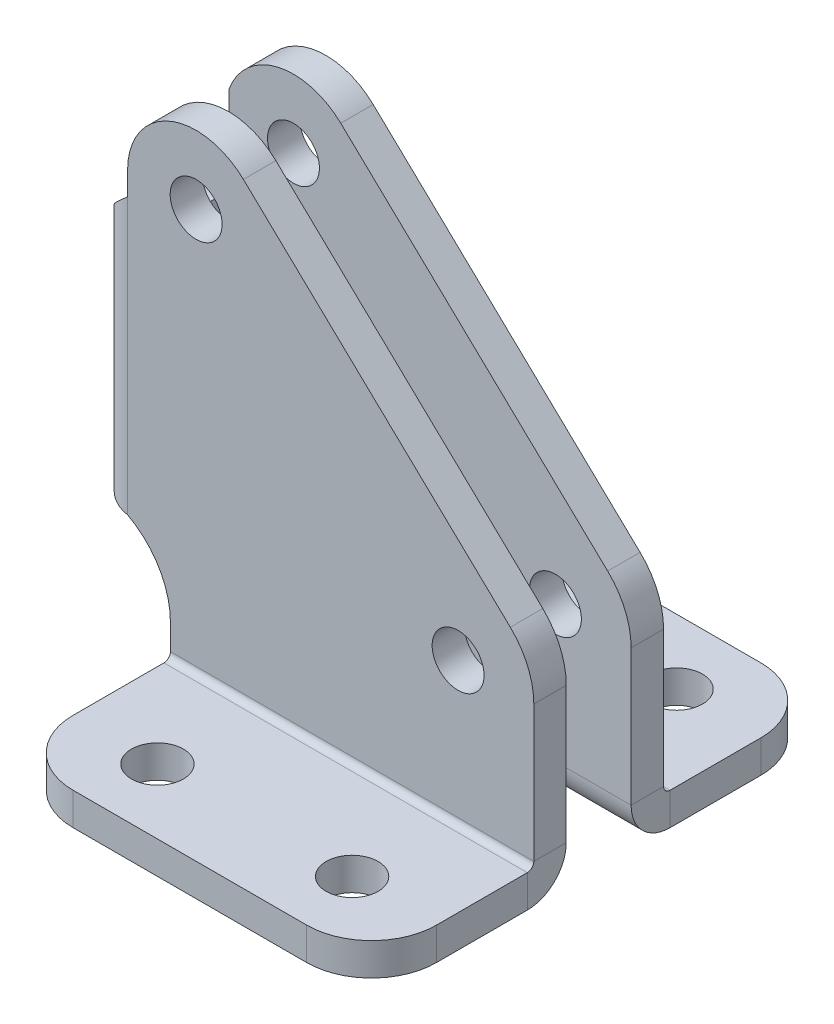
ISO-10303-21;
HEADER;
FILE_DESCRIPTION(('STEP AP214'),'2;1');
FILE_NAME('part.step','',(''),(''),'','','');
FILE_SCHEMA(('AUTOMOTIVE_DESIGN { 1 0 10303 214 1 1 1 1 }'));
ENDSEC;
DATA;
#1=APPLICATION_CONTEXT('core data for automotive mechanical design processes');
#2=APPLICATION_PROTOCOL_DEFINITION('international standard','automotive_design',2000,#1);
#3=PRODUCT_CONTEXT('',#1,'mechanical');
#4=PRODUCT('Part','Part','',(#3));
#5=PRODUCT_RELATED_PRODUCT_CATEGORY('part','',(#4));
#6=PRODUCT_DEFINITION_FORMATION('','',#4);
#7=PRODUCT_DEFINITION_CONTEXT('part definition',#1,'design');
#8=PRODUCT_DEFINITION('design','',#6,#7);
#9=PRODUCT_DEFINITION_SHAPE('','',#8);
#10=(LENGTH_UNIT() NAMED_UNIT(*) SI_UNIT(.MILLI.,.METRE.));
#11=(NAMED_UNIT(*) PLANE_ANGLE_UNIT() SI_UNIT($,.RADIAN.));
#12=(NAMED_UNIT(*) SI_UNIT($,.STERADIAN.) SOLID_ANGLE_UNIT());
#13=UNCERTAINTY_MEASURE_WITH_UNIT(LENGTH_MEASURE(1.E-05),#10,'distance_accuracy_value','');
#14=(GEOMETRIC_REPRESENTATION_CONTEXT(3) GLOBAL_UNCERTAINTY_ASSIGNED_CONTEXT((#13)) GLOBAL_UNIT_ASSIGNED_CONTEXT((#10,
#11,#12)) REPRESENTATION_CONTEXT('',''));
#15=CARTESIAN_POINT('',(0.,0.,0.));
#16=DIRECTION('',(0.,0.,1.));
#17=DIRECTION('',(1.,0.,0.));
#18=AXIS2_PLACEMENT_3D('',#15,#16,#17);
#19=CARTESIAN_POINT('',(34.671,50.8,9.525));
#20=DIRECTION('',(0.,-1.,0.));
#21=DIRECTION('',(0.,0.,-1.));
#22=AXIS2_PLACEMENT_3D('',#19,#20,#21);
#23=CYLINDRICAL_SURFACE('',#22,2.54);
#24=CARTESIAN_POINT('',(34.671,3.175,9.525));
#25=DIRECTION('',(0.,1.,0.));
#26=DIRECTION('',(0.,0.,1.));
#27=AXIS2_PLACEMENT_3D('',#24,#25,#26);
#28=CIRCLE('',#27,2.54);
#29=CARTESIAN_POINT('',(34.671,3.175,12.065));
#30=VERTEX_POINT('',#29);
#31=EDGE_CURVE('E852',#30,#30,#28,.F.);
#32=ORIENTED_EDGE('',*,*,#31,.F.);
#33=EDGE_LOOP('',(#32));
#34=FACE_BOUND('',#33,.T.);
#35=CARTESIAN_POINT('',(34.671,0.,9.525));
#36=DIRECTION('',(0.,1.,0.));
#37=DIRECTION('',(0.,0.,1.));
#38=AXIS2_PLACEMENT_3D('',#35,#36,#37);
#39=CIRCLE('',#38,2.54);
#40=CARTESIAN_POINT('',(34.671,0.,12.065));
#41=VERTEX_POINT('',#40);
#42=EDGE_CURVE('E864',#41,#41,#39,.T.);
#43=ORIENTED_EDGE('',*,*,#42,.F.);
#44=EDGE_LOOP('',(#43));
#45=FACE_BOUND('',#44,.T.);
#46=ADVANCED_FACE('F28',(#34,#45),#23,.F.);
#47=CARTESIAN_POINT('',(0.,0.,-12.7));
#48=DIRECTION('',(0.,-1.,0.));
#49=DIRECTION('',(0.,0.,-1.));
#50=AXIS2_PLACEMENT_3D('',#47,#48,#49);
#51=PLANE('',#50);
#52=DIRECTION('',(1.,0.,0.));
#53=VECTOR('',#52,1.);
#54=CARTESIAN_POINT('',(7.366,0.,15.875));
#55=LINE('',#54,#53);
#56=CARTESIAN_POINT('',(13.716,0.,15.875));
#57=VERTEX_POINT('',#56);
#58=CARTESIAN_POINT('',(36.576,0.,15.875));
#59=VERTEX_POINT('',#58);
#60=EDGE_CURVE('E838',#57,#59,#55,.T.);
#61=ORIENTED_EDGE('',*,*,#60,.F.);
#62=CARTESIAN_POINT('',(13.716,0.,9.52500000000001));
#63=DIRECTION('',(0.,-1.,0.));
#64=DIRECTION('',(0.,0.,-1.));
#65=AXIS2_PLACEMENT_3D('',#62,#63,#64);
#66=CIRCLE('',#65,6.35);
#67=CARTESIAN_POINT('',(7.366,0.,9.52500000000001));
#68=VERTEX_POINT('',#67);
#69=EDGE_CURVE('E835',#57,#68,#66,.T.);
#70=ORIENTED_EDGE('',*,*,#69,.T.);
#71=DIRECTION('',(0.,0.,-1.));
#72=VECTOR('',#71,1.);
#73=CARTESIAN_POINT('',(7.366,0.,0.));
#74=LINE('',#73,#72);
#75=CARTESIAN_POINT('',(7.366,0.,0.635));
#76=VERTEX_POINT('',#75);
#77=EDGE_CURVE('E43',#68,#76,#74,.T.);
#78=ORIENTED_EDGE('',*,*,#77,.T.);
#79=DIRECTION('',(-1.,0.,0.));
#80=VECTOR('',#79,1.);
#81=CARTESIAN_POINT('',(42.926,0.,0.635000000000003));
#82=LINE('',#81,#80);
#83=CARTESIAN_POINT('',(42.926,0.,0.635000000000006));
#84=VERTEX_POINT('',#83);
#85=EDGE_CURVE('E857',#76,#84,#82,.F.);
#86=ORIENTED_EDGE('',*,*,#85,.T.);
#87=DIRECTION('',(0.,0.,-1.));
#88=VECTOR('',#87,1.);
#89=CARTESIAN_POINT('',(42.926,0.,0.));
#90=LINE('',#89,#88);
#91=CARTESIAN_POINT('',(42.926,0.,9.52500000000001));
#92=VERTEX_POINT('',#91);
#93=EDGE_CURVE('E860',#92,#84,#90,.T.);
#94=ORIENTED_EDGE('',*,*,#93,.F.);
#95=CARTESIAN_POINT('',(36.576,0.,9.52500000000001));
#96=DIRECTION('',(0.,-1.,0.));
#97=DIRECTION('',(0.,0.,-1.));
#98=AXIS2_PLACEMENT_3D('',#95,#96,#97);
#99=CIRCLE('',#98,6.35);
#100=EDGE_CURVE('E848',#92,#59,#99,.T.);
#101=ORIENTED_EDGE('',*,*,#100,.T.);
#102=EDGE_LOOP('',(#61,#70,#78,#86,#94,#101));
#103=FACE_BOUND('',#102,.T.);
#104=CARTESIAN_POINT('',(15.621,0.,9.52500000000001));
#105=DIRECTION('',(0.,-1.,0.));
#106=DIRECTION('',(0.,0.,-1.));
#107=AXIS2_PLACEMENT_3D('',#104,#105,#106);
#108=CIRCLE('',#107,2.54);
#109=CARTESIAN_POINT('',(15.621,0.,6.985));
#110=VERTEX_POINT('',#109);
#111=EDGE_CURVE('E849',#110,#110,#108,.T.);
#112=ORIENTED_EDGE('',*,*,#111,.F.);
#113=EDGE_LOOP('',(#112));
#114=FACE_BOUND('',#113,.T.);
#115=ORIENTED_EDGE('',*,*,#42,.T.);
#116=EDGE_LOOP('',(#115));
#117=FACE_BOUND('',#116,.T.);
#118=ADVANCED_FACE('F803',(#103,#114,#117),#51,.T.);
#119=CARTESIAN_POINT('',(15.621,50.8,9.52500000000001));
#120=DIRECTION('',(0.,-1.,0.));
#121=DIRECTION('',(0.,0.,-1.));
#122=AXIS2_PLACEMENT_3D('',#119,#120,#121);
#123=CYLINDRICAL_SURFACE('',#122,2.54);
#124=CARTESIAN_POINT('',(15.621,3.175,9.52500000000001));
#125=DIRECTION('',(0.,1.,0.));
#126=DIRECTION('',(0.,0.,1.));
#127=AXIS2_PLACEMENT_3D('',#124,#125,#126);
#128=CIRCLE('',#127,2.54);
#129=CARTESIAN_POINT('',(15.621,3.175,12.065));
#130=VERTEX_POINT('',#129);
#131=EDGE_CURVE('E887',#130,#130,#128,.T.);
#132=ORIENTED_EDGE('',*,*,#131,.T.);
#133=EDGE_LOOP('',(#132));
#134=FACE_BOUND('',#133,.T.);
#135=ORIENTED_EDGE('',*,*,#111,.T.);
#136=EDGE_LOOP('',(#135));
#137=FACE_BOUND('',#136,.T.);
#138=ADVANCED_FACE('F795',(#134,#137),#123,.F.);
#139=CARTESIAN_POINT('',(42.926,3.175,15.875));
#140=DIRECTION('',(0.,1.,0.));
#141=DIRECTION('',(0.,0.,1.));
#142=AXIS2_PLACEMENT_3D('',#139,#140,#141);
#143=PLANE('',#142);
#144=DIRECTION('',(0.,0.,-1.));
#145=VECTOR('',#144,1.);
#146=CARTESIAN_POINT('',(7.366,3.175,15.875));
#147=LINE('',#146,#145);
#148=CARTESIAN_POINT('',(7.366,3.175,9.52500000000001));
#149=VERTEX_POINT('',#148);
#150=CARTESIAN_POINT('',(7.366,3.175,0.635));
#151=VERTEX_POINT('',#150);
#152=EDGE_CURVE('E881',#149,#151,#147,.T.);
#153=ORIENTED_EDGE('',*,*,#152,.F.);
#154=CARTESIAN_POINT('',(13.716,3.175,9.52500000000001));
#155=DIRECTION('',(0.,1.,0.));
#156=DIRECTION('',(0.,0.,1.));
#157=AXIS2_PLACEMENT_3D('',#154,#155,#156);
#158=CIRCLE('',#157,6.35);
#159=CARTESIAN_POINT('',(13.716,3.175,15.875));
#160=VERTEX_POINT('',#159);
#161=EDGE_CURVE('E49',#149,#160,#158,.T.);
#162=ORIENTED_EDGE('',*,*,#161,.T.);
#163=DIRECTION('',(1.,0.,0.));
#164=VECTOR('',#163,1.);
#165=CARTESIAN_POINT('',(7.366,3.175,15.875));
#166=LINE('',#165,#164);
#167=CARTESIAN_POINT('',(36.576,3.175,15.875));
#168=VERTEX_POINT('',#167);
#169=EDGE_CURVE('E843',#160,#168,#166,.T.);
#170=ORIENTED_EDGE('',*,*,#169,.T.);
#171=CARTESIAN_POINT('',(36.576,3.175,9.52500000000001));
#172=DIRECTION('',(0.,1.,0.));
#173=DIRECTION('',(0.,0.,1.));
#174=AXIS2_PLACEMENT_3D('',#171,#172,#173);
#175=CIRCLE('',#174,6.35);
#176=CARTESIAN_POINT('',(42.926,3.175,9.52500000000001));
#177=VERTEX_POINT('',#176);
#178=EDGE_CURVE('E876',#168,#177,#175,.T.);
#179=ORIENTED_EDGE('',*,*,#178,.T.);
#180=DIRECTION('',(0.,0.,1.));
#181=VECTOR('',#180,1.);
#182=CARTESIAN_POINT('',(42.926,3.175,-3.175));
#183=LINE('',#182,#181);
#184=CARTESIAN_POINT('',(42.926,3.175,0.635000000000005));
#185=VERTEX_POINT('',#184);
#186=EDGE_CURVE('E879',#185,#177,#183,.T.);
#187=ORIENTED_EDGE('',*,*,#186,.F.);
#188=DIRECTION('',(1.,0.,0.));
#189=VECTOR('',#188,1.);
#190=CARTESIAN_POINT('',(42.926,3.175,0.635000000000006));
#191=LINE('',#190,#189);
#192=EDGE_CURVE('E309',#185,#151,#191,.F.);
#193=ORIENTED_EDGE('',*,*,#192,.T.);
#194=EDGE_LOOP('',(#153,#162,#170,#179,#187,#193));
#195=FACE_BOUND('',#194,.T.);
#196=ORIENTED_EDGE('',*,*,#131,.F.);
#197=EDGE_LOOP('',(#196));
#198=FACE_BOUND('',#197,.T.);
#199=ORIENTED_EDGE('',*,*,#31,.T.);
#200=EDGE_LOOP('',(#199));
#201=FACE_BOUND('',#200,.T.);
#202=ADVANCED_FACE('F793',(#195,#198,#201),#143,.T.);
#203=CARTESIAN_POINT('',(7.366,80.5512547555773,15.875));
#204=DIRECTION('',(-1.,0.,0.));
#205=DIRECTION('',(0.,0.,1.));
#206=AXIS2_PLACEMENT_3D('',#203,#204,#205);
#207=PLANE('',#206);
#208=DIRECTION('',(0.,-1.,0.));
#209=VECTOR('',#208,1.);
#210=CARTESIAN_POINT('',(7.366,80.5512547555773,0.635));
#211=LINE('',#210,#209);
#212=EDGE_CURVE('E867',#151,#76,#211,.T.);
#213=ORIENTED_EDGE('',*,*,#212,.T.);
#214=ORIENTED_EDGE('',*,*,#77,.F.);
#215=DIRECTION('',(0.,-1.,0.));
#216=VECTOR('',#215,1.);
#217=CARTESIAN_POINT('',(7.366,80.5512547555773,9.52500000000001));
#218=LINE('',#217,#216);
#219=EDGE_CURVE('E11',#149,#68,#218,.T.);
#220=ORIENTED_EDGE('',*,*,#219,.F.);
#221=ORIENTED_EDGE('',*,*,#152,.T.);
#222=EDGE_LOOP('',(#213,#214,#220,#221));
#223=FACE_BOUND('',#222,.T.);
#224=ADVANCED_FACE('F30',(#223),#207,.T.);
#225=CARTESIAN_POINT('',(13.716,80.5512547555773,9.52500000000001));
#226=DIRECTION('',(0.,-1.,0.));
#227=DIRECTION('',(-1.,0.,0.));
#228=AXIS2_PLACEMENT_3D('',#225,#226,#227);
#229=CYLINDRICAL_SURFACE('',#228,6.35);
#230=ORIENTED_EDGE('',*,*,#69,.F.);
#231=DIRECTION('',(0.,-1.,0.));
#232=VECTOR('',#231,1.);
#233=CARTESIAN_POINT('',(13.716,80.5512547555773,15.875));
#234=LINE('',#233,#232);
#235=EDGE_CURVE('E36',#160,#57,#234,.T.);
#236=ORIENTED_EDGE('',*,*,#235,.F.);
#237=ORIENTED_EDGE('',*,*,#161,.F.);
#238=ORIENTED_EDGE('',*,*,#219,.T.);
#239=EDGE_LOOP('',(#230,#236,#237,#238));
#240=FACE_BOUND('',#239,.T.);
#241=ADVANCED_FACE('F802',(#240),#229,.T.);
#242=CARTESIAN_POINT('',(7.366,80.5512547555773,15.875));
#243=DIRECTION('',(0.,0.,-1.));
#244=DIRECTION('',(-1.,0.,0.));
#245=AXIS2_PLACEMENT_3D('',#242,#243,#244);
#246=PLANE('',#245);
#247=ORIENTED_EDGE('',*,*,#60,.T.);
#248=DIRECTION('',(0.,-1.,0.));
#249=VECTOR('',#248,1.);
#250=CARTESIAN_POINT('',(36.576,80.5512547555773,15.875));
#251=LINE('',#250,#249);
#252=EDGE_CURVE('E844',#168,#59,#251,.T.);
#253=ORIENTED_EDGE('',*,*,#252,.F.);
#254=ORIENTED_EDGE('',*,*,#169,.F.);
#255=ORIENTED_EDGE('',*,*,#235,.T.);
#256=EDGE_LOOP('',(#247,#253,#254,#255));
#257=FACE_BOUND('',#256,.T.);
#258=ADVANCED_FACE('F827',(#257),#246,.F.);
#259=CARTESIAN_POINT('',(36.576,80.5512547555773,9.52500000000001));
#260=DIRECTION('',(0.,-1.,0.));
#261=DIRECTION('',(-1.,0.,0.));
#262=AXIS2_PLACEMENT_3D('',#259,#260,#261);
#263=CYLINDRICAL_SURFACE('',#262,6.35);
#264=ORIENTED_EDGE('',*,*,#100,.F.);
#265=DIRECTION('',(0.,-1.,0.));
#266=VECTOR('',#265,1.);
#267=CARTESIAN_POINT('',(42.926,80.5512547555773,9.52500000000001));
#268=LINE('',#267,#266);
#269=EDGE_CURVE('E871',#177,#92,#268,.T.);
#270=ORIENTED_EDGE('',*,*,#269,.F.);
#271=ORIENTED_EDGE('',*,*,#178,.F.);
#272=ORIENTED_EDGE('',*,*,#252,.T.);
#273=EDGE_LOOP('',(#264,#270,#271,#272));
#274=FACE_BOUND('',#273,.T.);
#275=ADVANCED_FACE('F822',(#274),#263,.T.);
#276=CARTESIAN_POINT('',(42.926,80.5512547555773,-3.175));
#277=DIRECTION('',(1.,0.,0.));
#278=DIRECTION('',(0.,-1.,0.));
#279=AXIS2_PLACEMENT_3D('',#276,#277,#278);
#280=PLANE('',#279);
#281=ORIENTED_EDGE('',*,*,#269,.T.);
#282=ORIENTED_EDGE('',*,*,#93,.T.);
#283=DIRECTION('',(0.,-1.,0.));
#284=VECTOR('',#283,1.);
#285=CARTESIAN_POINT('',(42.926,80.5512547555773,0.635000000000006));
#286=LINE('',#285,#284);
#287=EDGE_CURVE('E869',#185,#84,#286,.T.);
#288=ORIENTED_EDGE('',*,*,#287,.F.);
#289=ORIENTED_EDGE('',*,*,#186,.T.);
#290=EDGE_LOOP('',(#281,#282,#288,#289));
#291=FACE_BOUND('',#290,.T.);
#292=ADVANCED_FACE('F818',(#291),#280,.T.);
#293=CARTESIAN_POINT('',(15.621,50.8,-22.225));
#294=DIRECTION('',(0.,-1.,0.));
#295=DIRECTION('',(0.,0.,-1.));
#296=AXIS2_PLACEMENT_3D('',#293,#294,#295);
#297=CYLINDRICAL_SURFACE('',#296,2.54);
#298=CARTESIAN_POINT('',(15.621,0.,-22.225));
#299=DIRECTION('',(0.,1.,0.));
#300=DIRECTION('',(0.,0.,1.));
#301=AXIS2_PLACEMENT_3D('',#298,#299,#300);
#302=CIRCLE('',#301,2.54);
#303=CARTESIAN_POINT('',(15.621,0.,-19.685));
#304=VERTEX_POINT('',#303);
#305=EDGE_CURVE('E1203',#304,#304,#302,.T.);
#306=ORIENTED_EDGE('',*,*,#305,.F.);
#307=EDGE_LOOP('',(#306));
#308=FACE_BOUND('',#307,.T.);
#309=CARTESIAN_POINT('',(15.621,3.175,-22.225));
#310=DIRECTION('',(0.,-1.,0.));
#311=DIRECTION('',(0.,0.,-1.));
#312=AXIS2_PLACEMENT_3D('',#309,#310,#311);
#313=CIRCLE('',#312,2.54);
#314=CARTESIAN_POINT('',(15.621,3.175,-24.765));
#315=VERTEX_POINT('',#314);
#316=EDGE_CURVE('E1192',#315,#315,#313,.F.);
#317=ORIENTED_EDGE('',*,*,#316,.T.);
#318=EDGE_LOOP('',(#317));
#319=FACE_BOUND('',#318,.T.);
#320=ADVANCED_FACE('F821',(#308,#319),#297,.F.);
#321=CARTESIAN_POINT('',(0.,0.,-12.7));
#322=DIRECTION('',(0.,-1.,0.));
#323=DIRECTION('',(0.,0.,-1.));
#324=AXIS2_PLACEMENT_3D('',#321,#322,#323);
#325=PLANE('',#324);
#326=DIRECTION('',(1.,0.,0.));
#327=VECTOR('',#326,1.);
#328=CARTESIAN_POINT('',(7.366,0.,-28.575));
#329=LINE('',#328,#327);
#330=CARTESIAN_POINT('',(13.716,0.,-28.575));
#331=VERTEX_POINT('',#330);
#332=CARTESIAN_POINT('',(36.576,0.,-28.575));
#333=VERTEX_POINT('',#332);
#334=EDGE_CURVE('E1177',#331,#333,#329,.T.);
#335=ORIENTED_EDGE('',*,*,#334,.T.);
#336=CARTESIAN_POINT('',(36.576,0.,-22.225));
#337=DIRECTION('',(0.,-1.,0.));
#338=DIRECTION('',(0.,0.,-1.));
#339=AXIS2_PLACEMENT_3D('',#336,#337,#338);
#340=CIRCLE('',#339,6.35);
#341=CARTESIAN_POINT('',(42.926,0.,-22.225));
#342=VERTEX_POINT('',#341);
#343=EDGE_CURVE('E1168',#333,#342,#340,.T.);
#344=ORIENTED_EDGE('',*,*,#343,.T.);
#345=DIRECTION('',(0.,0.,-1.));
#346=VECTOR('',#345,1.);
#347=CARTESIAN_POINT('',(42.926,0.,-9.52499999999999));
#348=LINE('',#347,#346);
#349=CARTESIAN_POINT('',(42.926,0.,-13.335));
#350=VERTEX_POINT('',#349);
#351=EDGE_CURVE('E1176',#350,#342,#348,.T.);
#352=ORIENTED_EDGE('',*,*,#351,.F.);
#353=DIRECTION('',(1.,0.,0.));
#354=VECTOR('',#353,1.);
#355=CARTESIAN_POINT('',(7.36600000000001,0.,-13.335));
#356=LINE('',#355,#354);
#357=CARTESIAN_POINT('',(7.36600000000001,0.,-13.335));
#358=VERTEX_POINT('',#357);
#359=EDGE_CURVE('E1197',#350,#358,#356,.F.);
#360=ORIENTED_EDGE('',*,*,#359,.T.);
#361=DIRECTION('',(0.,0.,-1.));
#362=VECTOR('',#361,1.);
#363=CARTESIAN_POINT('',(7.36600000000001,0.,-12.7));
#364=LINE('',#363,#362);
#365=CARTESIAN_POINT('',(7.366,0.,-22.225));
#366=VERTEX_POINT('',#365);
#367=EDGE_CURVE('E1200',#358,#366,#364,.T.);
#368=ORIENTED_EDGE('',*,*,#367,.T.);
#369=CARTESIAN_POINT('',(13.716,0.,-22.225));
#370=DIRECTION('',(0.,-1.,0.));
#371=DIRECTION('',(0.,0.,-1.));
#372=AXIS2_PLACEMENT_3D('',#369,#370,#371);
#373=CIRCLE('',#372,6.35);
#374=EDGE_CURVE('E1188',#366,#331,#373,.T.);
#375=ORIENTED_EDGE('',*,*,#374,.T.);
#376=EDGE_LOOP('',(#335,#344,#352,#360,#368,#375));
#377=FACE_BOUND('',#376,.T.);
#378=CARTESIAN_POINT('',(34.671,0.,-22.225));
#379=DIRECTION('',(0.,-1.,0.));
#380=DIRECTION('',(0.,0.,-1.));
#381=AXIS2_PLACEMENT_3D('',#378,#379,#380);
#382=CIRCLE('',#381,2.54);
#383=CARTESIAN_POINT('',(34.671,0.,-24.765));
#384=VERTEX_POINT('',#383);
#385=EDGE_CURVE('E1189',#384,#384,#382,.T.);
#386=ORIENTED_EDGE('',*,*,#385,.F.);
#387=EDGE_LOOP('',(#386));
#388=FACE_BOUND('',#387,.T.);
#389=ORIENTED_EDGE('',*,*,#305,.T.);
#390=EDGE_LOOP('',(#389));
#391=FACE_BOUND('',#390,.T.);
#392=ADVANCED_FACE('F1140',(#377,#388,#391),#325,.T.);
#393=CARTESIAN_POINT('',(34.671,50.8,-22.225));
#394=DIRECTION('',(0.,-1.,0.));
#395=DIRECTION('',(0.,0.,-1.));
#396=AXIS2_PLACEMENT_3D('',#393,#394,#395);
#397=CYLINDRICAL_SURFACE('',#396,2.54);
#398=ORIENTED_EDGE('',*,*,#385,.T.);
#399=EDGE_LOOP('',(#398));
#400=FACE_BOUND('',#399,.T.);
#401=CARTESIAN_POINT('',(34.671,3.175,-22.225));
#402=DIRECTION('',(0.,-1.,0.));
#403=DIRECTION('',(0.,0.,-1.));
#404=AXIS2_PLACEMENT_3D('',#401,#402,#403);
#405=CIRCLE('',#404,2.54);
#406=CARTESIAN_POINT('',(34.671,3.175,-24.765));
#407=VERTEX_POINT('',#406);
#408=EDGE_CURVE('E1385',#407,#407,#405,.T.);
#409=ORIENTED_EDGE('',*,*,#408,.F.);
#410=EDGE_LOOP('',(#409));
#411=FACE_BOUND('',#410,.T.);
#412=ADVANCED_FACE('F1136',(#400,#411),#397,.F.);
#413=CARTESIAN_POINT('',(7.366,3.175,-28.575));
#414=DIRECTION('',(0.,-1.,0.));
#415=DIRECTION('',(0.,0.,-1.));
#416=AXIS2_PLACEMENT_3D('',#413,#414,#415);
#417=PLANE('',#416);
#418=DIRECTION('',(0.,0.,-1.));
#419=VECTOR('',#418,1.);
#420=CARTESIAN_POINT('',(42.926,3.17500000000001,-9.525));
#421=LINE('',#420,#419);
#422=CARTESIAN_POINT('',(42.926,3.175,-13.335));
#423=VERTEX_POINT('',#422);
#424=CARTESIAN_POINT('',(42.926,3.175,-22.225));
#425=VERTEX_POINT('',#424);
#426=EDGE_CURVE('E735',#423,#425,#421,.T.);
#427=ORIENTED_EDGE('',*,*,#426,.T.);
#428=CARTESIAN_POINT('',(36.576,3.175,-22.225));
#429=DIRECTION('',(0.,-1.,0.));
#430=DIRECTION('',(0.,0.,-1.));
#431=AXIS2_PLACEMENT_3D('',#428,#429,#430);
#432=CIRCLE('',#431,6.35);
#433=CARTESIAN_POINT('',(36.576,3.175,-28.575));
#434=VERTEX_POINT('',#433);
#435=EDGE_CURVE('E741',#425,#434,#432,.F.);
#436=ORIENTED_EDGE('',*,*,#435,.T.);
#437=DIRECTION('',(1.,0.,0.));
#438=VECTOR('',#437,1.);
#439=CARTESIAN_POINT('',(7.366,3.175,-28.575));
#440=LINE('',#439,#438);
#441=CARTESIAN_POINT('',(13.716,3.175,-28.575));
#442=VERTEX_POINT('',#441);
#443=EDGE_CURVE('E1182',#442,#434,#440,.T.);
#444=ORIENTED_EDGE('',*,*,#443,.F.);
#445=CARTESIAN_POINT('',(13.716,3.175,-22.225));
#446=DIRECTION('',(0.,-1.,0.));
#447=DIRECTION('',(0.,0.,-1.));
#448=AXIS2_PLACEMENT_3D('',#445,#446,#447);
#449=CIRCLE('',#448,6.35);
#450=CARTESIAN_POINT('',(7.366,3.175,-22.225));
#451=VERTEX_POINT('',#450);
#452=EDGE_CURVE('E1379',#442,#451,#449,.F.);
#453=ORIENTED_EDGE('',*,*,#452,.T.);
#454=DIRECTION('',(0.,0.,1.));
#455=VECTOR('',#454,1.);
#456=CARTESIAN_POINT('',(7.366,3.175,-28.575));
#457=LINE('',#456,#455);
#458=CARTESIAN_POINT('',(7.36600000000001,3.175,-13.335));
#459=VERTEX_POINT('',#458);
#460=EDGE_CURVE('E1377',#451,#459,#457,.T.);
#461=ORIENTED_EDGE('',*,*,#460,.T.);
#462=DIRECTION('',(1.,0.,0.));
#463=VECTOR('',#462,1.);
#464=CARTESIAN_POINT('',(42.926,3.175,-13.335));
#465=LINE('',#464,#463);
#466=EDGE_CURVE('E1364',#459,#423,#465,.T.);
#467=ORIENTED_EDGE('',*,*,#466,.T.);
#468=EDGE_LOOP('',(#427,#436,#444,#453,#461,#467));
#469=FACE_BOUND('',#468,.T.);
#470=ORIENTED_EDGE('',*,*,#408,.T.);
#471=EDGE_LOOP('',(#470));
#472=FACE_BOUND('',#471,.T.);
#473=ORIENTED_EDGE('',*,*,#316,.F.);
#474=EDGE_LOOP('',(#473));
#475=FACE_BOUND('',#474,.T.);
#476=ADVANCED_FACE('F824',(#469,#472,#475),#417,.F.);
#477=CARTESIAN_POINT('',(42.926,80.5512547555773,-9.52500000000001));
#478=DIRECTION('',(-1.,0.,0.));
#479=DIRECTION('',(0.,0.,1.));
#480=AXIS2_PLACEMENT_3D('',#477,#478,#479);
#481=PLANE('',#480);
#482=ORIENTED_EDGE('',*,*,#351,.T.);
#483=DIRECTION('',(0.,-1.,0.));
#484=VECTOR('',#483,1.);
#485=CARTESIAN_POINT('',(42.926,80.5512547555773,-22.225));
#486=LINE('',#485,#484);
#487=EDGE_CURVE('E1173',#425,#342,#486,.T.);
#488=ORIENTED_EDGE('',*,*,#487,.F.);
#489=ORIENTED_EDGE('',*,*,#426,.F.);
#490=DIRECTION('',(0.,-1.,0.));
#491=VECTOR('',#490,1.);
#492=CARTESIAN_POINT('',(42.926,80.5512547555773,-13.335));
#493=LINE('',#492,#491);
#494=EDGE_CURVE('E1206',#423,#350,#493,.T.);
#495=ORIENTED_EDGE('',*,*,#494,.T.);
#496=EDGE_LOOP('',(#482,#488,#489,#495));
#497=FACE_BOUND('',#496,.T.);
#498=ADVANCED_FACE('F809',(#497),#481,.F.);
#499=CARTESIAN_POINT('',(36.576,80.5512547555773,-22.225));
#500=DIRECTION('',(0.,-1.,0.));
#501=DIRECTION('',(1.,0.,0.));
#502=AXIS2_PLACEMENT_3D('',#499,#500,#501);
#503=CYLINDRICAL_SURFACE('',#502,6.35);
#504=ORIENTED_EDGE('',*,*,#343,.F.);
#505=DIRECTION('',(0.,-1.,0.));
#506=VECTOR('',#505,1.);
#507=CARTESIAN_POINT('',(36.576,80.5512547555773,-28.575));
#508=LINE('',#507,#506);
#509=EDGE_CURVE('E1171',#434,#333,#508,.T.);
#510=ORIENTED_EDGE('',*,*,#509,.F.);
#511=ORIENTED_EDGE('',*,*,#435,.F.);
#512=ORIENTED_EDGE('',*,*,#487,.T.);
#513=EDGE_LOOP('',(#504,#510,#511,#512));
#514=FACE_BOUND('',#513,.T.);
#515=ADVANCED_FACE('F1157',(#514),#503,.T.);
#516=CARTESIAN_POINT('',(7.366,80.5512547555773,-28.575));
#517=DIRECTION('',(0.,0.,-1.));
#518=DIRECTION('',(-1.,0.,0.));
#519=AXIS2_PLACEMENT_3D('',#516,#517,#518);
#520=PLANE('',#519);
#521=ORIENTED_EDGE('',*,*,#509,.T.);
#522=ORIENTED_EDGE('',*,*,#334,.F.);
#523=DIRECTION('',(0.,-1.,0.));
#524=VECTOR('',#523,1.);
#525=CARTESIAN_POINT('',(13.716,80.5512547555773,-28.575));
#526=LINE('',#525,#524);
#527=EDGE_CURVE('E1183',#442,#331,#526,.T.);
#528=ORIENTED_EDGE('',*,*,#527,.F.);
#529=ORIENTED_EDGE('',*,*,#443,.T.);
#530=EDGE_LOOP('',(#521,#522,#528,#529));
#531=FACE_BOUND('',#530,.T.);
#532=ADVANCED_FACE('F1154',(#531),#520,.T.);
#533=CARTESIAN_POINT('',(13.716,80.5512547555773,-22.225));
#534=DIRECTION('',(0.,-1.,0.));
#535=DIRECTION('',(1.,0.,0.));
#536=AXIS2_PLACEMENT_3D('',#533,#534,#535);
#537=CYLINDRICAL_SURFACE('',#536,6.35);
#538=ORIENTED_EDGE('',*,*,#374,.F.);
#539=DIRECTION('',(0.,-1.,0.));
#540=VECTOR('',#539,1.);
#541=CARTESIAN_POINT('',(7.366,80.5512547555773,-22.225));
#542=LINE('',#541,#540);
#543=EDGE_CURVE('E1211',#451,#366,#542,.T.);
#544=ORIENTED_EDGE('',*,*,#543,.F.);
#545=ORIENTED_EDGE('',*,*,#452,.F.);
#546=ORIENTED_EDGE('',*,*,#527,.T.);
#547=EDGE_LOOP('',(#538,#544,#545,#546));
#548=FACE_BOUND('',#547,.T.);
#549=ADVANCED_FACE('F1150',(#548),#537,.T.);
#550=CARTESIAN_POINT('',(7.366,80.5512547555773,-28.575));
#551=DIRECTION('',(1.,0.,0.));
#552=DIRECTION('',(0.,0.,-1.));
#553=AXIS2_PLACEMENT_3D('',#550,#551,#552);
#554=PLANE('',#553);
#555=ORIENTED_EDGE('',*,*,#367,.F.);
#556=DIRECTION('',(0.,-1.,0.));
#557=VECTOR('',#556,1.);
#558=CARTESIAN_POINT('',(7.366,80.5512547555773,-13.335));
#559=LINE('',#558,#557);
#560=EDGE_CURVE('E1209',#459,#358,#559,.T.);
#561=ORIENTED_EDGE('',*,*,#560,.F.);
#562=ORIENTED_EDGE('',*,*,#460,.F.);
#563=ORIENTED_EDGE('',*,*,#543,.T.);
#564=EDGE_LOOP('',(#555,#561,#562,#563));
#565=FACE_BOUND('',#564,.T.);
#566=ADVANCED_FACE('F770',(#565),#554,.F.);
#567=CARTESIAN_POINT('',(35.5178915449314,17.145,-28.575));
#568=DIRECTION('',(0.,0.,1.));
#569=DIRECTION('',(1.,0.,0.));
#570=AXIS2_PLACEMENT_3D('',#567,#568,#569);
#571=CYLINDRICAL_SURFACE('',#570,2.54);
#572=CARTESIAN_POINT('',(35.5178915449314,17.145,-9.52499999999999));
#573=DIRECTION('',(0.,0.,-1.));
#574=DIRECTION('',(-1.,0.,0.));
#575=AXIS2_PLACEMENT_3D('',#572,#573,#574);
#576=CIRCLE('',#575,2.54);
#577=CARTESIAN_POINT('',(38.0578915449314,17.145,-9.52499999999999));
#578=VERTEX_POINT('',#577);
#579=EDGE_CURVE('E1399',#578,#578,#576,.T.);
#580=CARTESIAN_POINT('',(35.5178915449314,17.145,-12.7));
#581=DIRECTION('',(0.,0.,1.));
#582=DIRECTION('',(1.,0.,0.));
#583=AXIS2_PLACEMENT_3D('',#580,#581,#582);
#584=CIRCLE('',#583,2.54);
#585=CARTESIAN_POINT('',(38.0578915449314,17.145,-12.7));
#586=VERTEX_POINT('',#585);
#587=EDGE_CURVE('E1099',#586,#586,#584,.T.);
#588=CARTESIAN_POINT('',(38.0578915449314,17.145,-9.52499999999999));
#589=CARTESIAN_POINT('',(38.0578915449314,17.145,-9.55807291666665));
#590=CARTESIAN_POINT('',(38.0578915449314,17.145,-9.59114583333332));
#591=CARTESIAN_POINT('',(38.0578915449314,17.145,-9.65729166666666));
#592=CARTESIAN_POINT('',(38.0578915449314,17.145,-9.69036458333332));
#593=CARTESIAN_POINT('',(38.0578915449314,17.145,-9.75651041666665));
#594=CARTESIAN_POINT('',(38.0578915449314,17.145,-9.78958333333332));
#595=CARTESIAN_POINT('',(38.0578915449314,17.145,-9.85572916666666));
#596=CARTESIAN_POINT('',(38.0578915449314,17.145,-9.88880208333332));
#597=CARTESIAN_POINT('',(38.0578915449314,17.145,-9.95494791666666));
#598=CARTESIAN_POINT('',(38.0578915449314,17.145,-9.98802083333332));
#599=CARTESIAN_POINT('',(38.0578915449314,17.145,-10.0541666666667));
#600=CARTESIAN_POINT('',(38.0578915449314,17.145,-10.0872395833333));
#601=CARTESIAN_POINT('',(38.0578915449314,17.145,-10.1533854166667));
#602=CARTESIAN_POINT('',(38.0578915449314,17.145,-10.1864583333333));
#603=CARTESIAN_POINT('',(38.0578915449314,17.145,-10.2526041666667));
#604=CARTESIAN_POINT('',(38.0578915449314,17.145,-10.2856770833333));
#605=CARTESIAN_POINT('',(38.0578915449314,17.145,-10.3518229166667));
#606=CARTESIAN_POINT('',(38.0578915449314,17.145,-10.3848958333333));
#607=CARTESIAN_POINT('',(38.0578915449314,17.145,-10.4510416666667));
#608=CARTESIAN_POINT('',(38.0578915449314,17.145,-10.4841145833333));
#609=CARTESIAN_POINT('',(38.0578915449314,17.145,-10.5502604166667));
#610=CARTESIAN_POINT('',(38.0578915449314,17.145,-10.5833333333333));
#611=CARTESIAN_POINT('',(38.0578915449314,17.145,-10.6494791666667));
#612=CARTESIAN_POINT('',(38.0578915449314,17.145,-10.6825520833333));
#613=CARTESIAN_POINT('',(38.0578915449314,17.145,-10.7486979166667));
#614=CARTESIAN_POINT('',(38.0578915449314,17.145,-10.7817708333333));
#615=CARTESIAN_POINT('',(38.0578915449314,17.145,-10.8479166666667));
#616=CARTESIAN_POINT('',(38.0578915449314,17.145,-10.8809895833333));
#617=CARTESIAN_POINT('',(38.0578915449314,17.145,-10.9471354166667));
#618=CARTESIAN_POINT('',(38.0578915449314,17.145,-10.9802083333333));
#619=CARTESIAN_POINT('',(38.0578915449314,17.145,-11.0463541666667));
#620=CARTESIAN_POINT('',(38.0578915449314,17.145,-11.0794270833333));
#621=CARTESIAN_POINT('',(38.0578915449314,17.145,-11.1455729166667));
#622=CARTESIAN_POINT('',(38.0578915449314,17.145,-11.1786458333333));
#623=CARTESIAN_POINT('',(38.0578915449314,17.145,-11.2447916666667));
#624=CARTESIAN_POINT('',(38.0578915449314,17.145,-11.2778645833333));
#625=CARTESIAN_POINT('',(38.0578915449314,17.145,-11.3440104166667));
#626=CARTESIAN_POINT('',(38.0578915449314,17.145,-11.3770833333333));
#627=CARTESIAN_POINT('',(38.0578915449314,17.145,-11.4432291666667));
#628=CARTESIAN_POINT('',(38.0578915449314,17.145,-11.4763020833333));
#629=CARTESIAN_POINT('',(38.0578915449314,17.145,-11.5424479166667));
#630=CARTESIAN_POINT('',(38.0578915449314,17.145,-11.5755208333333));
#631=CARTESIAN_POINT('',(38.0578915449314,17.145,-11.6416666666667));
#632=CARTESIAN_POINT('',(38.0578915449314,17.145,-11.6747395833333));
#633=CARTESIAN_POINT('',(38.0578915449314,17.145,-11.7408854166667));
#634=CARTESIAN_POINT('',(38.0578915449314,17.145,-11.7739583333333));
#635=CARTESIAN_POINT('',(38.0578915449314,17.145,-11.8401041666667));
#636=CARTESIAN_POINT('',(38.0578915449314,17.145,-11.8731770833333));
#637=CARTESIAN_POINT('',(38.0578915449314,17.145,-11.9393229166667));
#638=CARTESIAN_POINT('',(38.0578915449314,17.145,-11.9723958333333));
#639=CARTESIAN_POINT('',(38.0578915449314,17.145,-12.0385416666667));
#640=CARTESIAN_POINT('',(38.0578915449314,17.145,-12.0716145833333));
#641=CARTESIAN_POINT('',(38.0578915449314,17.145,-12.1377604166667));
#642=CARTESIAN_POINT('',(38.0578915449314,17.145,-12.1708333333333));
#643=CARTESIAN_POINT('',(38.0578915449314,17.145,-12.2369791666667));
#644=CARTESIAN_POINT('',(38.0578915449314,17.145,-12.2700520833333));
#645=CARTESIAN_POINT('',(38.0578915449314,17.145,-12.3361979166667));
#646=CARTESIAN_POINT('',(38.0578915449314,17.145,-12.3692708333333));
#647=CARTESIAN_POINT('',(38.0578915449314,17.145,-12.4354166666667));
#648=CARTESIAN_POINT('',(38.0578915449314,17.145,-12.4684895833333));
#649=CARTESIAN_POINT('',(38.0578915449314,17.145,-12.5346354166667));
#650=CARTESIAN_POINT('',(38.0578915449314,17.145,-12.5677083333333));
#651=CARTESIAN_POINT('',(38.0578915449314,17.145,-12.6338541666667));
#652=CARTESIAN_POINT('',(38.0578915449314,17.145,-12.6669270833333));
#653=CARTESIAN_POINT('',(38.0578915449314,17.145,-12.7));
#654=B_SPLINE_CURVE_WITH_KNOTS('',3,(#588,#589,#590,#591,#592,#593,#594,#595,#596,#597,#598,
#599,#600,#601,#602,#603,#604,#605,#606,#607,#608,#609,#610,#611,#612,#613,#614,#615,#616,#617,
#618,#619,#620,#621,#622,#623,#624,#625,#626,#627,#628,#629,#630,#631,#632,#633,#634,#635,#636,
#637,#638,#639,#640,#641,#642,#643,#644,#645,#646,#647,#648,#649,#650,#651,#652,#653),
.UNSPECIFIED.,.F.,.F.,(4,2,2,2,2,2,2,2,2,2,2,2,2,2,2,2,2,2,2,2,2,2,2,2,2,2,2,2,2,2,2,2,4),(0.,
0.0992187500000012,0.198437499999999,0.29765625,0.396875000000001,0.496093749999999,0.5953125,
0.694531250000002,0.793750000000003,0.892968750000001,0.992187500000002,1.09140625,1.190625,
1.28984375,1.3890625,1.48828125,1.5875,1.68671875,1.7859375,1.88515625,1.984375,2.08359375,
2.1828125,2.28203125,2.38125,2.48046875,2.5796875,2.67890625,2.778125,2.87734375,
2.97656250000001,3.07578125,3.175),.UNSPECIFIED.);
#655=EDGE_CURVE('BSEAM777',#578,#586,#654,.T.);
#656=ORIENTED_EDGE('',*,*,#579,.F.);
#657=ORIENTED_EDGE('',*,*,#587,.F.);
#658=ORIENTED_EDGE('',*,*,#655,.T.);
#659=ORIENTED_EDGE('',*,*,#655,.F.);
#660=EDGE_LOOP('',(#656,#658,#657,#659));
#661=FACE_BOUND('',#660,.T.);
#662=ADVANCED_FACE('F777',(#661),#571,.F.);
#663=CARTESIAN_POINT('',(42.926,50.8,-12.7));
#664=DIRECTION('',(0.,0.,1.));
#665=DIRECTION('',(1.,0.,0.));
#666=AXIS2_PLACEMENT_3D('',#663,#664,#665);
#667=PLANE('',#666);
#668=CARTESIAN_POINT('',(9.88176936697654,42.545,-12.7));
#669=DIRECTION('',(0.,0.,1.));
#670=DIRECTION('',(1.,0.,0.));
#671=AXIS2_PLACEMENT_3D('',#668,#669,#670);
#672=CIRCLE('',#671,2.54);
#673=CARTESIAN_POINT('',(12.4217693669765,42.545,-12.7));
#674=VERTEX_POINT('',#673);
#675=EDGE_CURVE('E1096',#674,#674,#672,.T.);
#676=ORIENTED_EDGE('',*,*,#675,.T.);
#677=EDGE_LOOP('',(#676));
#678=FACE_BOUND('',#677,.T.);
#679=ORIENTED_EDGE('',*,*,#587,.T.);
#680=EDGE_LOOP('',(#679));
#681=FACE_BOUND('',#680,.T.);
#682=CARTESIAN_POINT('',(35.5178915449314,17.145,-12.7));
#683=DIRECTION('',(0.,0.,1.));
#684=DIRECTION('',(1.,0.,0.));
#685=AXIS2_PLACEMENT_3D('',#682,#683,#684);
#686=CIRCLE('',#685,7.40810845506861);
#687=CARTESIAN_POINT('',(42.926,17.145,-12.7));
#688=VERTEX_POINT('',#687);
#689=CARTESIAN_POINT('',(40.628668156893,22.5078381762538,-12.7));
#690=VERTEX_POINT('',#689);
#691=EDGE_CURVE('E1102',#688,#690,#686,.T.);
#692=ORIENTED_EDGE('',*,*,#691,.F.);
#693=DIRECTION('',(0.,-1.,0.));
#694=VECTOR('',#693,1.);
#695=CARTESIAN_POINT('',(42.926,50.8,-12.7));
#696=LINE('',#695,#694);
#697=CARTESIAN_POINT('',(42.926,3.81,-12.7));
#698=VERTEX_POINT('',#697);
#699=EDGE_CURVE('E1104',#688,#698,#696,.T.);
#700=ORIENTED_EDGE('',*,*,#699,.T.);
#701=DIRECTION('',(1.,0.,0.));
#702=VECTOR('',#701,1.);
#703=CARTESIAN_POINT('',(7.36600000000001,3.81,-12.7));
#704=LINE('',#703,#702);
#705=CARTESIAN_POINT('',(7.36600000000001,3.81,-12.7));
#706=VERTEX_POINT('',#705);
#707=EDGE_CURVE('E1106',#698,#706,#704,.F.);
#708=ORIENTED_EDGE('',*,*,#707,.T.);
#709=DIRECTION('',(0.,-1.,0.));
#710=VECTOR('',#709,1.);
#711=CARTESIAN_POINT('',(7.36600000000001,50.8,-12.7));
#712=LINE('',#711,#710);
#713=CARTESIAN_POINT('',(7.36600000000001,6.30710073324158,-12.7));
#714=VERTEX_POINT('',#713);
#715=EDGE_CURVE('E704',#714,#706,#712,.T.);
#716=ORIENTED_EDGE('',*,*,#715,.F.);
#717=CARTESIAN_POINT('',(-0.571499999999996,6.30710073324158,-12.7));
#718=DIRECTION('',(0.,0.,1.));
#719=DIRECTION('',(1.,0.,0.));
#720=AXIS2_PLACEMENT_3D('',#717,#718,#719);
#721=CIRCLE('',#720,7.9375);
#722=CARTESIAN_POINT('',(3.17500000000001,13.3047892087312,-12.7));
#723=VERTEX_POINT('',#722);
#724=EDGE_CURVE('E699',#723,#714,#721,.F.);
#725=ORIENTED_EDGE('',*,*,#724,.F.);
#726=DIRECTION('',(0.,-1.,0.));
#727=VECTOR('',#726,1.);
#728=CARTESIAN_POINT('',(3.175,50.8,-12.7));
#729=LINE('',#728,#727);
#730=CARTESIAN_POINT('',(3.17500000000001,40.259,-12.7));
#731=VERTEX_POINT('',#730);
#732=EDGE_CURVE('E698',#723,#731,#729,.F.);
#733=ORIENTED_EDGE('',*,*,#732,.T.);
#734=CARTESIAN_POINT('',(3.175,42.545,-12.7));
#735=VERTEX_POINT('',#734);
#736=EDGE_CURVE('E695',#731,#735,#729,.F.);
#737=ORIENTED_EDGE('',*,*,#736,.T.);
#738=CARTESIAN_POINT('',(9.88176936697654,42.545,-12.7));
#739=DIRECTION('',(0.,0.,1.));
#740=DIRECTION('',(1.,0.,0.));
#741=AXIS2_PLACEMENT_3D('',#738,#739,#740);
#742=CIRCLE('',#741,6.70676936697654);
#743=CARTESIAN_POINT('',(14.5086994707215,47.4001285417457,-12.7));
#744=VERTEX_POINT('',#743);
#745=EDGE_CURVE('E706',#744,#735,#742,.T.);
#746=ORIENTED_EDGE('',*,*,#745,.F.);
#747=DIRECTION('',(0.723914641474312,-0.689889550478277,0.));
#748=VECTOR('',#747,1.);
#749=CARTESIAN_POINT('',(27.7028865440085,34.826088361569,-12.7));
#750=LINE('',#749,#748);
#751=EDGE_CURVE('E710',#744,#690,#750,.T.);
#752=ORIENTED_EDGE('',*,*,#751,.T.);
#753=EDGE_LOOP('',(#692,#700,#708,#716,#725,#733,#737,#746,#752));
#754=FACE_BOUND('',#753,.T.);
#755=ADVANCED_FACE('F773',(#678,#681,#754),#667,.F.);
#756=CARTESIAN_POINT('',(9.88176936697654,42.545,-28.575));
#757=DIRECTION('',(0.,0.,1.));
#758=DIRECTION('',(1.,0.,0.));
#759=AXIS2_PLACEMENT_3D('',#756,#757,#758);
#760=CYLINDRICAL_SURFACE('',#759,2.54);
#761=CARTESIAN_POINT('',(9.88176936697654,42.545,-9.525));
#762=DIRECTION('',(0.,0.,-1.));
#763=DIRECTION('',(-1.,0.,0.));
#764=AXIS2_PLACEMENT_3D('',#761,#762,#763);
#765=CIRCLE('',#764,2.54);
#766=CARTESIAN_POINT('',(12.4217693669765,42.545,-9.525));
#767=VERTEX_POINT('',#766);
#768=EDGE_CURVE('E1402',#767,#767,#765,.T.);
#769=CARTESIAN_POINT('',(12.4217693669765,42.545,-9.525));
#770=CARTESIAN_POINT('',(12.4217693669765,42.545,-9.55807291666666));
#771=CARTESIAN_POINT('',(12.4217693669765,42.545,-9.59114583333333));
#772=CARTESIAN_POINT('',(12.4217693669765,42.545,-9.65729166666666));
#773=CARTESIAN_POINT('',(12.4217693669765,42.545,-9.69036458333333));
#774=CARTESIAN_POINT('',(12.4217693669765,42.545,-9.75651041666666));
#775=CARTESIAN_POINT('',(12.4217693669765,42.545,-9.78958333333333));
#776=CARTESIAN_POINT('',(12.4217693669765,42.545,-9.85572916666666));
#777=CARTESIAN_POINT('',(12.4217693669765,42.545,-9.88880208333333));
#778=CARTESIAN_POINT('',(12.4217693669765,42.545,-9.95494791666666));
#779=CARTESIAN_POINT('',(12.4217693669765,42.545,-9.98802083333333));
#780=CARTESIAN_POINT('',(12.4217693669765,42.545,-10.0541666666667));
#781=CARTESIAN_POINT('',(12.4217693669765,42.545,-10.0872395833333));
#782=CARTESIAN_POINT('',(12.4217693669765,42.545,-10.1533854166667));
#783=CARTESIAN_POINT('',(12.4217693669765,42.545,-10.1864583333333));
#784=CARTESIAN_POINT('',(12.4217693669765,42.545,-10.2526041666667));
#785=CARTESIAN_POINT('',(12.4217693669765,42.545,-10.2856770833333));
#786=CARTESIAN_POINT('',(12.4217693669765,42.545,-10.3518229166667));
#787=CARTESIAN_POINT('',(12.4217693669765,42.545,-10.3848958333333));
#788=CARTESIAN_POINT('',(12.4217693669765,42.545,-10.4510416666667));
#789=CARTESIAN_POINT('',(12.4217693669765,42.545,-10.4841145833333));
#790=CARTESIAN_POINT('',(12.4217693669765,42.545,-10.5502604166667));
#791=CARTESIAN_POINT('',(12.4217693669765,42.545,-10.5833333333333));
#792=CARTESIAN_POINT('',(12.4217693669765,42.545,-10.6494791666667));
#793=CARTESIAN_POINT('',(12.4217693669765,42.545,-10.6825520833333));
#794=CARTESIAN_POINT('',(12.4217693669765,42.545,-10.7486979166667));
#795=CARTESIAN_POINT('',(12.4217693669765,42.545,-10.7817708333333));
#796=CARTESIAN_POINT('',(12.4217693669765,42.545,-10.8479166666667));
#797=CARTESIAN_POINT('',(12.4217693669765,42.545,-10.8809895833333));
#798=CARTESIAN_POINT('',(12.4217693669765,42.545,-10.9471354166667));
#799=CARTESIAN_POINT('',(12.4217693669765,42.545,-10.9802083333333));
#800=CARTESIAN_POINT('',(12.4217693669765,42.545,-11.0463541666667));
#801=CARTESIAN_POINT('',(12.4217693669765,42.545,-11.0794270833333));
#802=CARTESIAN_POINT('',(12.4217693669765,42.545,-11.1455729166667));
#803=CARTESIAN_POINT('',(12.4217693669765,42.545,-11.1786458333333));
#804=CARTESIAN_POINT('',(12.4217693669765,42.545,-11.2447916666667));
#805=CARTESIAN_POINT('',(12.4217693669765,42.545,-11.2778645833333));
#806=CARTESIAN_POINT('',(12.4217693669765,42.545,-11.3440104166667));
#807=CARTESIAN_POINT('',(12.4217693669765,42.545,-11.3770833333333));
#808=CARTESIAN_POINT('',(12.4217693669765,42.545,-11.4432291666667));
#809=CARTESIAN_POINT('',(12.4217693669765,42.545,-11.4763020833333));
#810=CARTESIAN_POINT('',(12.4217693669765,42.545,-11.5424479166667));
#811=CARTESIAN_POINT('',(12.4217693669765,42.545,-11.5755208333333));
#812=CARTESIAN_POINT('',(12.4217693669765,42.545,-11.6416666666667));
#813=CARTESIAN_POINT('',(12.4217693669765,42.545,-11.6747395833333));
#814=CARTESIAN_POINT('',(12.4217693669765,42.545,-11.7408854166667));
#815=CARTESIAN_POINT('',(12.4217693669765,42.545,-11.7739583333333));
#816=CARTESIAN_POINT('',(12.4217693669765,42.545,-11.8401041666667));
#817=CARTESIAN_POINT('',(12.4217693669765,42.545,-11.8731770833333));
#818=CARTESIAN_POINT('',(12.4217693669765,42.545,-11.9393229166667));
#819=CARTESIAN_POINT('',(12.4217693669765,42.545,-11.9723958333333));
#820=CARTESIAN_POINT('',(12.4217693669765,42.545,-12.0385416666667));
#821=CARTESIAN_POINT('',(12.4217693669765,42.545,-12.0716145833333));
#822=CARTESIAN_POINT('',(12.4217693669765,42.545,-12.1377604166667));
#823=CARTESIAN_POINT('',(12.4217693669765,42.545,-12.1708333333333));
#824=CARTESIAN_POINT('',(12.4217693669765,42.545,-12.2369791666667));
#825=CARTESIAN_POINT('',(12.4217693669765,42.545,-12.2700520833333));
#826=CARTESIAN_POINT('',(12.4217693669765,42.545,-12.3361979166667));
#827=CARTESIAN_POINT('',(12.4217693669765,42.545,-12.3692708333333));
#828=CARTESIAN_POINT('',(12.4217693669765,42.545,-12.4354166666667));
#829=CARTESIAN_POINT('',(12.4217693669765,42.545,-12.4684895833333));
#830=CARTESIAN_POINT('',(12.4217693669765,42.545,-12.5346354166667));
#831=CARTESIAN_POINT('',(12.4217693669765,42.545,-12.5677083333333));
#832=CARTESIAN_POINT('',(12.4217693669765,42.545,-12.6338541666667));
#833=CARTESIAN_POINT('',(12.4217693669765,42.545,-12.6669270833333));
#834=CARTESIAN_POINT('',(12.4217693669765,42.545,-12.7));
#835=B_SPLINE_CURVE_WITH_KNOTS('',3,(#769,#770,#771,#772,#773,#774,#775,#776,#777,#778,#779,
#780,#781,#782,#783,#784,#785,#786,#787,#788,#789,#790,#791,#792,#793,#794,#795,#796,#797,#798,
#799,#800,#801,#802,#803,#804,#805,#806,#807,#808,#809,#810,#811,#812,#813,#814,#815,#816,#817,
#818,#819,#820,#821,#822,#823,#824,#825,#826,#827,#828,#829,#830,#831,#832,#833,#834),
.UNSPECIFIED.,.F.,.F.,(4,2,2,2,2,2,2,2,2,2,2,2,2,2,2,2,2,2,2,2,2,2,2,2,2,2,2,2,2,2,2,2,4),(0.,
0.0992187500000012,0.198437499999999,0.29765625,0.396874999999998,0.496093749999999,0.5953125,
0.694531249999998,0.793749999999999,0.892968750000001,0.992187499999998,1.09140625,1.190625,
1.28984375,1.3890625,1.48828125,1.5875,1.68671875,1.7859375,1.88515625,1.984375,2.08359375,
2.1828125,2.28203125,2.38125,2.48046875,2.5796875,2.67890625,2.778125,2.87734375,2.9765625,
3.07578125,3.175),.UNSPECIFIED.);
#836=EDGE_CURVE('BSEAM768',#767,#674,#835,.T.);
#837=ORIENTED_EDGE('',*,*,#768,.F.);
#838=ORIENTED_EDGE('',*,*,#675,.F.);
#839=ORIENTED_EDGE('',*,*,#836,.T.);
#840=ORIENTED_EDGE('',*,*,#836,.F.);
#841=EDGE_LOOP('',(#837,#839,#838,#840));
#842=FACE_BOUND('',#841,.T.);
#843=ADVANCED_FACE('F768',(#842),#760,.F.);
#844=CARTESIAN_POINT('',(3.175,50.8,-9.525));
#845=DIRECTION('',(0.,0.,-1.));
#846=DIRECTION('',(-1.,0.,0.));
#847=AXIS2_PLACEMENT_3D('',#844,#845,#846);
#848=PLANE('',#847);
#849=ORIENTED_EDGE('',*,*,#768,.T.);
#850=EDGE_LOOP('',(#849));
#851=FACE_BOUND('',#850,.T.);
#852=ORIENTED_EDGE('',*,*,#579,.T.);
#853=EDGE_LOOP('',(#852));
#854=FACE_BOUND('',#853,.T.);
#855=CARTESIAN_POINT('',(9.88176936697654,42.545,-9.525));
#856=DIRECTION('',(0.,0.,-1.));
#857=DIRECTION('',(-1.,0.,0.));
#858=AXIS2_PLACEMENT_3D('',#855,#856,#857);
#859=CIRCLE('',#858,6.70676936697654);
#860=CARTESIAN_POINT('',(3.571875,44.8178810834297,-9.52499999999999));
#861=VERTEX_POINT('',#860);
#862=CARTESIAN_POINT('',(14.5086994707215,47.4001285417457,-9.525));
#863=VERTEX_POINT('',#862);
#864=EDGE_CURVE('E1084',#861,#863,#859,.T.);
#865=ORIENTED_EDGE('',*,*,#864,.F.);
#866=DIRECTION('',(0.,1.,0.));
#867=VECTOR('',#866,1.);
#868=CARTESIAN_POINT('',(3.571875,10.3807681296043,-9.525));
#869=LINE('',#868,#867);
#870=CARTESIAN_POINT('',(3.571875,13.0773555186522,-9.52499999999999));
#871=VERTEX_POINT('',#870);
#872=EDGE_CURVE('E1406',#861,#871,#869,.F.);
#873=ORIENTED_EDGE('',*,*,#872,.T.);
#874=CARTESIAN_POINT('',(-0.571499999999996,6.30710073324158,-9.525));
#875=DIRECTION('',(0.,0.,-1.));
#876=DIRECTION('',(-1.,0.,0.));
#877=AXIS2_PLACEMENT_3D('',#874,#875,#876);
#878=CIRCLE('',#877,7.9375);
#879=CARTESIAN_POINT('',(7.36600000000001,6.30710073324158,-9.52499999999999));
#880=VERTEX_POINT('',#879);
#881=EDGE_CURVE('E1080',#880,#871,#878,.F.);
#882=ORIENTED_EDGE('',*,*,#881,.F.);
#883=DIRECTION('',(0.,1.,0.));
#884=VECTOR('',#883,1.);
#885=CARTESIAN_POINT('',(7.36600000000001,50.8,-9.525));
#886=LINE('',#885,#884);
#887=CARTESIAN_POINT('',(7.36600000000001,3.81,-9.52499999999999));
#888=VERTEX_POINT('',#887);
#889=EDGE_CURVE('E1083',#888,#880,#886,.T.);
#890=ORIENTED_EDGE('',*,*,#889,.F.);
#891=DIRECTION('',(1.,0.,0.));
#892=VECTOR('',#891,1.);
#893=CARTESIAN_POINT('',(42.926,3.81,-9.52499999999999));
#894=LINE('',#893,#892);
#895=CARTESIAN_POINT('',(42.926,3.81,-9.52499999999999));
#896=VERTEX_POINT('',#895);
#897=EDGE_CURVE('E1086',#888,#896,#894,.T.);
#898=ORIENTED_EDGE('',*,*,#897,.T.);
#899=DIRECTION('',(0.,-1.,0.));
#900=VECTOR('',#899,1.);
#901=CARTESIAN_POINT('',(42.926,50.8,-9.52499999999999));
#902=LINE('',#901,#900);
#903=CARTESIAN_POINT('',(42.926,17.145,-9.525));
#904=VERTEX_POINT('',#903);
#905=EDGE_CURVE('E1094',#904,#896,#902,.T.);
#906=ORIENTED_EDGE('',*,*,#905,.F.);
#907=CARTESIAN_POINT('',(35.5178915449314,17.145,-9.52499999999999));
#908=DIRECTION('',(0.,0.,-1.));
#909=DIRECTION('',(-1.,0.,0.));
#910=AXIS2_PLACEMENT_3D('',#907,#908,#909);
#911=CIRCLE('',#910,7.40810845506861);
#912=CARTESIAN_POINT('',(40.628668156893,22.5078381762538,-9.52499999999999));
#913=VERTEX_POINT('',#912);
#914=EDGE_CURVE('E1397',#913,#904,#911,.T.);
#915=ORIENTED_EDGE('',*,*,#914,.F.);
#916=DIRECTION('',(-0.723914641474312,0.689889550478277,0.));
#917=VECTOR('',#916,1.);
#918=CARTESIAN_POINT('',(6.87127926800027,54.6785783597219,-9.525));
#919=LINE('',#918,#917);
#920=EDGE_CURVE('E1088',#913,#863,#919,.T.);
#921=ORIENTED_EDGE('',*,*,#920,.T.);
#922=EDGE_LOOP('',(#865,#873,#882,#890,#898,#906,#915,#921));
#923=FACE_BOUND('',#922,.T.);
#924=ADVANCED_FACE('F763',(#851,#854,#923),#848,.F.);
#925=CARTESIAN_POINT('',(35.5178915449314,17.145,108.049267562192));
#926=DIRECTION('',(0.,0.,-1.));
#927=DIRECTION('',(-1.,0.,0.));
#928=AXIS2_PLACEMENT_3D('',#925,#926,#927);
#929=CYLINDRICAL_SURFACE('',#928,7.40810845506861);
#930=ORIENTED_EDGE('',*,*,#691,.T.);
#931=DIRECTION('',(0.,0.,-1.));
#932=VECTOR('',#931,1.);
#933=CARTESIAN_POINT('',(40.628668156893,22.5078381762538,108.049267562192));
#934=LINE('',#933,#932);
#935=EDGE_CURVE('E693',#913,#690,#934,.T.);
#936=ORIENTED_EDGE('',*,*,#935,.F.);
#937=ORIENTED_EDGE('',*,*,#914,.T.);
#938=DIRECTION('',(0.,0.,-1.));
#939=VECTOR('',#938,1.);
#940=CARTESIAN_POINT('',(42.926,17.145,108.049267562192));
#941=LINE('',#940,#939);
#942=EDGE_CURVE('E713',#904,#688,#941,.T.);
#943=ORIENTED_EDGE('',*,*,#942,.T.);
#944=EDGE_LOOP('',(#930,#936,#937,#943));
#945=FACE_BOUND('',#944,.T.);
#946=ADVANCED_FACE('F767',(#945),#929,.T.);
#947=CARTESIAN_POINT('',(6.87127926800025,54.678578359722,108.049267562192));
#948=DIRECTION('',(-0.689889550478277,-0.723914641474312,0.));
#949=DIRECTION('',(-0.723914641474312,0.689889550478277,0.));
#950=AXIS2_PLACEMENT_3D('',#947,#948,#949);
#951=PLANE('',#950);
#952=ORIENTED_EDGE('',*,*,#935,.T.);
#953=ORIENTED_EDGE('',*,*,#751,.F.);
#954=DIRECTION('',(0.,0.,-1.));
#955=VECTOR('',#954,1.);
#956=CARTESIAN_POINT('',(14.5086994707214,47.4001285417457,108.049267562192));
#957=LINE('',#956,#955);
#958=EDGE_CURVE('E726',#863,#744,#957,.T.);
#959=ORIENTED_EDGE('',*,*,#958,.F.);
#960=ORIENTED_EDGE('',*,*,#920,.F.);
#961=EDGE_LOOP('',(#952,#953,#959,#960));
#962=FACE_BOUND('',#961,.T.);
#963=ADVANCED_FACE('F1128',(#962),#951,.F.);
#964=CARTESIAN_POINT('',(9.88176936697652,42.545,108.049267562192));
#965=DIRECTION('',(0.,0.,-1.));
#966=DIRECTION('',(-1.,0.,0.));
#967=AXIS2_PLACEMENT_3D('',#964,#965,#966);
#968=CYLINDRICAL_SURFACE('',#967,6.70676936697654);
#969=CARTESIAN_POINT('',(3.571875,44.8178810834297,-9.52499999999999));
#970=CARTESIAN_POINT('',(3.57188400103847,44.8179046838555,-9.53358681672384));
#971=CARTESIAN_POINT('',(3.57159674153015,44.8171086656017,-9.54213913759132));
#972=CARTESIAN_POINT('',(3.57051400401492,44.8141000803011,-9.55884803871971));
#973=CARTESIAN_POINT('',(3.56972515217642,44.8119059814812,-9.56700830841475));
#974=CARTESIAN_POINT('',(3.56748395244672,44.8056564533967,-9.5847009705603));
#975=CARTESIAN_POINT('',(3.56591921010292,44.8012846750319,-9.59410484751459));
#976=CARTESIAN_POINT('',(3.56231335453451,44.7911657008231,-9.61207819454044));
#977=CARTESIAN_POINT('',(3.56026972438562,44.785411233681,-9.62064290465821));
#978=CARTESIAN_POINT('',(3.55442613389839,44.7688706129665,-9.64221887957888));
#979=CARTESIAN_POINT('',(3.55034790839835,44.757244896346,-9.65450244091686));
#980=CARTESIAN_POINT('',(3.54174122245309,44.7324580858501,-9.67717606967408));
#981=CARTESIAN_POINT('',(3.53721190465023,44.7192940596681,-9.68756242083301));
#982=CARTESIAN_POINT('',(3.52649348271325,44.6877968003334,-9.7098203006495));
#983=CARTESIAN_POINT('',(3.52022329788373,44.6691214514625,-9.72116195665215));
#984=CARTESIAN_POINT('',(3.50754735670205,44.6307755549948,-9.74195545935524));
#985=CARTESIAN_POINT('',(3.50114136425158,44.6111031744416,-9.75140365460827));
#986=CARTESIAN_POINT('',(3.4883005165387,44.5710198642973,-9.76886557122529));
#987=CARTESIAN_POINT('',(3.48186567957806,44.5506056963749,-9.77687177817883));
#988=CARTESIAN_POINT('',(3.46908239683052,44.5093492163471,-9.79168436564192));
#989=CARTESIAN_POINT('',(3.46273388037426,44.4885072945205,-9.79849178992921));
#990=CARTESIAN_POINT('',(3.44630101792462,44.4335851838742,-9.81502389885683));
#991=CARTESIAN_POINT('',(3.43631852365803,44.3992409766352,-9.82397034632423));
#992=CARTESIAN_POINT('',(3.41679550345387,44.32998356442,-9.83996396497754));
#993=CARTESIAN_POINT('',(3.40725522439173,44.2950700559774,-9.84701008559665));
#994=CARTESIAN_POINT('',(3.37936112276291,44.1896062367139,-9.86596650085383));
#995=CARTESIAN_POINT('',(3.36177135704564,44.1184569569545,-9.87566132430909));
#996=CARTESIAN_POINT('',(3.32881137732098,43.9750148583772,-9.89130619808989));
#997=CARTESIAN_POINT('',(3.31344932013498,43.9027188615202,-9.89724274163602));
#998=CARTESIAN_POINT('',(3.28511437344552,43.7575833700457,-9.90658426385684));
#999=CARTESIAN_POINT('',(3.27213901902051,43.6847445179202,-9.90999186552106));
#1000=CARTESIAN_POINT('',(3.24607266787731,43.5229394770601,-9.91573405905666));
#1001=CARTESIAN_POINT('',(3.23355488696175,43.4338681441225,-9.91768123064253));
#1002=CARTESIAN_POINT('',(3.21210614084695,43.2552424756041,-9.92028325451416));
#1003=CARTESIAN_POINT('',(3.20317675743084,43.1656879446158,-9.92093753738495));
#1004=CARTESIAN_POINT('',(3.18903686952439,42.9876502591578,-9.9216891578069));
#1005=CARTESIAN_POINT('',(3.18377195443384,42.8991714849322,-9.92179480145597));
#1006=CARTESIAN_POINT('',(3.1785083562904,42.7663789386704,-9.92186275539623));
#1007=CARTESIAN_POINT('',(3.17719278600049,42.7221137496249,-9.92187033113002));
#1008=CARTESIAN_POINT('',(3.17543861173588,42.6335661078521,-9.92187530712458));
#1009=CARTESIAN_POINT('',(3.17500000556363,42.5892836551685,-9.92187270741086));
#1010=CARTESIAN_POINT('',(3.175,42.545,-9.921875));
#1011=B_SPLINE_CURVE_WITH_KNOTS('',3,(#969,#970,#971,#972,#973,#974,#975,#976,#977,#978,#979,
#980,#981,#982,#983,#984,#985,#986,#987,#988,#989,#990,#991,#992,#993,#994,#995,#996,#997,#998,
#999,#1000,#1001,#1002,#1003,#1004,#1005,#1006,#1007,#1008,#1009,#1010),.UNSPECIFIED.,.F.,.F.,
(4,2,2,2,2,2,2,2,2,2,2,2,2,2,2,2,2,2,2,2,4),(0.,0.0256633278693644,0.050994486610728,
0.0822816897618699,0.113737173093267,0.165635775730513,0.217634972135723,0.285671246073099,
0.353837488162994,0.422349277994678,0.490801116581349,0.601320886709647,0.711901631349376,
0.93346374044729,1.1558176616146,1.37794063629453,1.64775060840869,1.91767938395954,
2.18350941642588,2.31635613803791,2.44920252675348),.UNSPECIFIED.);
#1012=CARTESIAN_POINT('',(3.175,42.545,-9.921875));
#1013=VERTEX_POINT('',#1012);
#1014=EDGE_CURVE('E683',#861,#1013,#1011,.T.);
#1015=ORIENTED_EDGE('',*,*,#1014,.F.);
#1016=ORIENTED_EDGE('',*,*,#864,.T.);
#1017=ORIENTED_EDGE('',*,*,#958,.T.);
#1018=ORIENTED_EDGE('',*,*,#745,.T.);
#1019=DIRECTION('',(0.,0.,-1.));
#1020=VECTOR('',#1019,1.);
#1021=CARTESIAN_POINT('',(3.17499999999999,42.545,108.049267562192));
#1022=LINE('',#1021,#1020);
#1023=EDGE_CURVE('E724',#1013,#735,#1022,.T.);
#1024=ORIENTED_EDGE('',*,*,#1023,.F.);
#1025=EDGE_LOOP('',(#1015,#1016,#1017,#1018,#1024));
#1026=FACE_BOUND('',#1025,.T.);
#1027=ADVANCED_FACE('F1123',(#1026),#968,.T.);
#1028=CARTESIAN_POINT('',(3.17499999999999,50.8,108.049267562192));
#1029=DIRECTION('',(1.,0.,0.));
#1030=DIRECTION('',(0.,0.,-1.));
#1031=AXIS2_PLACEMENT_3D('',#1028,#1029,#1030);
#1032=PLANE('',#1031);
#1033=ORIENTED_EDGE('',*,*,#736,.F.);
#1034=CARTESIAN_POINT('',(3.175,40.259,-9.92187499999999));
#1035=CARTESIAN_POINT('',(3.175,40.259,-12.7));
#1036=B_SPLINE_CURVE_WITH_KNOTS('',1,(#1034,#1035),.UNSPECIFIED.,.F.,.F.,(2,2),(0.,1.),.UNSPECIFIED.);
#1037=CARTESIAN_POINT('',(3.175,40.259,-9.921875));
#1038=VERTEX_POINT('',#1037);
#1039=EDGE_CURVE('E660',#1038,#731,#1036,.T.);
#1040=ORIENTED_EDGE('',*,*,#1039,.F.);
#1041=DIRECTION('',(0.,1.,0.));
#1042=VECTOR('',#1041,1.);
#1043=CARTESIAN_POINT('',(3.175,10.3807681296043,-9.92187499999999));
#1044=LINE('',#1043,#1042);
#1045=EDGE_CURVE('E690',#1038,#1013,#1044,.T.);
#1046=ORIENTED_EDGE('',*,*,#1045,.T.);
#1047=ORIENTED_EDGE('',*,*,#1023,.T.);
#1048=EDGE_LOOP('',(#1033,#1040,#1046,#1047));
#1049=FACE_BOUND('',#1048,.T.);
#1050=ADVANCED_FACE('F790',(#1049),#1032,.F.);
#1051=CARTESIAN_POINT('',(-0.571500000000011,6.30710073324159,108.049267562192));
#1052=DIRECTION('',(0.,0.,-1.));
#1053=DIRECTION('',(-1.,0.,0.));
#1054=AXIS2_PLACEMENT_3D('',#1051,#1052,#1053);
#1055=CYLINDRICAL_SURFACE('',#1054,7.9375);
#1056=CARTESIAN_POINT('',(3.175,13.3047892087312,-9.92187499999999));
#1057=CARTESIAN_POINT('',(3.20013660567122,13.2913380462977,-9.92187645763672));
#1058=CARTESIAN_POINT('',(3.22519824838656,13.2777394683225,-9.91948689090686));
#1059=CARTESIAN_POINT('',(3.27456347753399,13.2506209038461,-9.91000685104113));
#1060=CARTESIAN_POINT('',(3.2988644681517,13.2371012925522,-9.90290180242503));
#1061=CARTESIAN_POINT('',(3.34596248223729,13.2105876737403,-9.88406233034));
#1062=CARTESIAN_POINT('',(3.36875775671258,13.1975942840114,-9.8723226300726));
#1063=CARTESIAN_POINT('',(3.41204377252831,13.1726601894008,-9.84434753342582));
#1064=CARTESIAN_POINT('',(3.43253665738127,13.1607185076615,-9.82811636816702));
#1065=CARTESIAN_POINT('',(3.4692260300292,13.1391477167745,-9.7924969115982));
#1066=CARTESIAN_POINT('',(3.4856073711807,13.12942243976,-9.77335884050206));
#1067=CARTESIAN_POINT('',(3.5147601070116,13.1120014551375,-9.73168094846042));
#1068=CARTESIAN_POINT('',(3.52753442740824,13.1043041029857,-9.70914390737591));
#1069=CARTESIAN_POINT('',(3.54709920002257,13.0924643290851,-9.66482966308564));
#1070=CARTESIAN_POINT('',(3.55448594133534,13.087969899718,-9.6434091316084));
#1071=CARTESIAN_POINT('',(3.56551167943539,13.081248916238,-9.59931540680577));
#1072=CARTESIAN_POINT('',(3.56916270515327,13.0790150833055,-9.57664648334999));
#1073=CARTESIAN_POINT('',(3.57117643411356,13.0777829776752,-9.54903072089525));
#1074=CARTESIAN_POINT('',(3.57143842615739,13.0776226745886,-9.54422661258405));
#1075=CARTESIAN_POINT('',(3.57178738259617,13.0774091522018,-9.53461570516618));
#1076=CARTESIAN_POINT('',(3.57187456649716,13.0773557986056,-9.52980891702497));
#1077=CARTESIAN_POINT('',(3.571875,13.0773555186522,-9.52499999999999));
#1078=B_SPLINE_CURVE_WITH_KNOTS('',3,(#1056,#1057,#1058,#1059,#1060,#1061,#1062,#1063,#1064,
#1065,#1066,#1067,#1068,#1069,#1070,#1071,#1072,#1073,#1074,#1075,#1076,#1077),.UNSPECIFIED.,
.F.,.F.,(4,2,2,2,2,2,2,2,2,2,4),(0.,0.0854371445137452,0.171139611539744,0.25693993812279,
0.342659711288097,0.42319671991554,0.503668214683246,0.572569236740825,0.641247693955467,
0.655687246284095,0.670108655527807),.UNSPECIFIED.);
#1079=CARTESIAN_POINT('',(3.175,13.3047892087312,-9.92187499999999));
#1080=VERTEX_POINT('',#1079);
#1081=EDGE_CURVE('E732',#1080,#871,#1078,.T.);
#1082=ORIENTED_EDGE('',*,*,#1081,.F.);
#1083=CARTESIAN_POINT('',(3.17500000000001,13.3047892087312,-12.7));
#1084=CARTESIAN_POINT('',(3.175,13.3047892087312,-9.92187499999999));
#1085=B_SPLINE_CURVE_WITH_KNOTS('',1,(#1083,#1084),.UNSPECIFIED.,.F.,.F.,(2,2),(0.,1.),.UNSPECIFIED.);
#1086=EDGE_CURVE('E1076',#1080,#723,#1085,.F.);
#1087=ORIENTED_EDGE('',*,*,#1086,.T.);
#1088=ORIENTED_EDGE('',*,*,#724,.T.);
#1089=DIRECTION('',(0.,0.,-1.));
#1090=VECTOR('',#1089,1.);
#1091=CARTESIAN_POINT('',(7.36599999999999,6.30710073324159,108.049267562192));
#1092=LINE('',#1091,#1090);
#1093=EDGE_CURVE('E721',#880,#714,#1092,.T.);
#1094=ORIENTED_EDGE('',*,*,#1093,.F.);
#1095=ORIENTED_EDGE('',*,*,#881,.T.);
#1096=EDGE_LOOP('',(#1082,#1087,#1088,#1094,#1095));
#1097=FACE_BOUND('',#1096,.T.);
#1098=ADVANCED_FACE('F754',(#1097),#1055,.F.);
#1099=CARTESIAN_POINT('',(7.36599999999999,50.8,108.049267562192));
#1100=DIRECTION('',(-1.,0.,0.));
#1101=DIRECTION('',(0.,0.,1.));
#1102=AXIS2_PLACEMENT_3D('',#1099,#1100,#1101);
#1103=PLANE('',#1102);
#1104=ORIENTED_EDGE('',*,*,#715,.T.);
#1105=DIRECTION('',(0.,0.,-1.));
#1106=VECTOR('',#1105,1.);
#1107=CARTESIAN_POINT('',(7.36599999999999,3.81000000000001,108.049267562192));
#1108=LINE('',#1107,#1106);
#1109=EDGE_CURVE('E718',#888,#706,#1108,.T.);
#1110=ORIENTED_EDGE('',*,*,#1109,.F.);
#1111=ORIENTED_EDGE('',*,*,#889,.T.);
#1112=ORIENTED_EDGE('',*,*,#1093,.T.);
#1113=EDGE_LOOP('',(#1104,#1110,#1111,#1112));
#1114=FACE_BOUND('',#1113,.T.);
#1115=ADVANCED_FACE('F783',(#1114),#1103,.T.);
#1116=CARTESIAN_POINT('',(42.926,50.8,108.049267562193));
#1117=DIRECTION('',(1.,0.,0.));
#1118=DIRECTION('',(0.,0.,-1.));
#1119=AXIS2_PLACEMENT_3D('',#1116,#1117,#1118);
#1120=PLANE('',#1119);
#1121=ORIENTED_EDGE('',*,*,#699,.F.);
#1122=ORIENTED_EDGE('',*,*,#942,.F.);
#1123=ORIENTED_EDGE('',*,*,#905,.T.);
#1124=DIRECTION('',(0.,0.,-1.));
#1125=VECTOR('',#1124,1.);
#1126=CARTESIAN_POINT('',(42.926,3.81000000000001,108.049267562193));
#1127=LINE('',#1126,#1125);
#1128=EDGE_CURVE('E716',#896,#698,#1127,.T.);
#1129=ORIENTED_EDGE('',*,*,#1128,.T.);
#1130=EDGE_LOOP('',(#1121,#1122,#1123,#1129));
#1131=FACE_BOUND('',#1130,.T.);
#1132=ADVANCED_FACE('F762',(#1131),#1120,.T.);
#1133=CARTESIAN_POINT('',(3.175,10.3807681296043,-9.52499999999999));
#1134=DIRECTION('',(0.,1.,0.));
#1135=DIRECTION('',(0.,0.,1.));
#1136=AXIS2_PLACEMENT_3D('',#1133,#1134,#1135);
#1137=CYLINDRICAL_SURFACE('',#1136,0.396875);
#1138=ORIENTED_EDGE('',*,*,#1014,.T.);
#1139=ORIENTED_EDGE('',*,*,#1045,.F.);
#1140=DIRECTION('',(0.,1.,0.));
#1141=VECTOR('',#1140,1.);
#1142=CARTESIAN_POINT('',(3.175,-79.6606842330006,-9.92187499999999));
#1143=LINE('',#1142,#1141);
#1144=EDGE_CURVE('E1067',#1038,#1080,#1143,.F.);
#1145=ORIENTED_EDGE('',*,*,#1144,.T.);
#1146=ORIENTED_EDGE('',*,*,#1081,.T.);
#1147=ORIENTED_EDGE('',*,*,#872,.F.);
#1148=EDGE_LOOP('',(#1138,#1139,#1145,#1146,#1147));
#1149=FACE_BOUND('',#1148,.T.);
#1150=ADVANCED_FACE('F758',(#1149),#1137,.F.);
#1151=CARTESIAN_POINT('',(45.0089146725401,14.224,0.));
#1152=DIRECTION('',(0.,1.,0.));
#1153=DIRECTION('',(-1.,0.,0.));
#1154=AXIS2_PLACEMENT_3D('',#1151,#1152,#1153);
#1155=PLANE('',#1154);
#1156=CARTESIAN_POINT('',(2.778125,14.224,-9.52499999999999));
#1157=CARTESIAN_POINT('',(0.,14.224,-9.52499999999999));
#1158=B_SPLINE_CURVE_WITH_KNOTS('',1,(#1156,#1157),.UNSPECIFIED.,.F.,.F.,(2,2),(0.,1.),.UNSPECIFIED.);
#1159=CARTESIAN_POINT('',(2.778125,14.224,-9.52499999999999));
#1160=VERTEX_POINT('',#1159);
#1161=CARTESIAN_POINT('',(0.,14.224,-9.52499999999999));
#1162=VERTEX_POINT('',#1161);
#1163=EDGE_CURVE('E672',#1160,#1162,#1158,.T.);
#1164=ORIENTED_EDGE('',*,*,#1163,.F.);
#1165=CARTESIAN_POINT('',(3.175,14.224,-9.52499999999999));
#1166=DIRECTION('',(0.,1.,0.));
#1167=DIRECTION('',(0.,0.,1.));
#1168=AXIS2_PLACEMENT_3D('',#1165,#1166,#1167);
#1169=CIRCLE('',#1168,0.396875);
#1170=CARTESIAN_POINT('',(3.175,14.224,-9.12812499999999));
#1171=VERTEX_POINT('',#1170);
#1172=EDGE_CURVE('E659',#1160,#1171,#1169,.T.);
#1173=ORIENTED_EDGE('',*,*,#1172,.T.);
#1174=DIRECTION('',(0.,0.,1.));
#1175=VECTOR('',#1174,1.);
#1176=CARTESIAN_POINT('',(3.175,14.224,0.));
#1177=LINE('',#1176,#1175);
#1178=CARTESIAN_POINT('',(3.175,14.224,-3.57187499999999));
#1179=VERTEX_POINT('',#1178);
#1180=EDGE_CURVE('E1051',#1171,#1179,#1177,.T.);
#1181=ORIENTED_EDGE('',*,*,#1180,.T.);
#1182=CARTESIAN_POINT('',(3.175,14.224,-3.17499999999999));
#1183=DIRECTION('',(0.,1.,0.));
#1184=DIRECTION('',(0.,0.,1.));
#1185=AXIS2_PLACEMENT_3D('',#1182,#1183,#1184);
#1186=CIRCLE('',#1185,0.396875);
#1187=CARTESIAN_POINT('',(2.778125,14.2239999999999,-3.17499999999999));
#1188=VERTEX_POINT('',#1187);
#1189=EDGE_CURVE('E606',#1179,#1188,#1186,.T.);
#1190=ORIENTED_EDGE('',*,*,#1189,.T.);
#1191=CARTESIAN_POINT('',(0.,14.224,-3.17499999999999));
#1192=CARTESIAN_POINT('',(2.778125,14.224,-3.17499999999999));
#1193=B_SPLINE_CURVE_WITH_KNOTS('',1,(#1191,#1192),.UNSPECIFIED.,.F.,.F.,(2,2),(0.,1.),.UNSPECIFIED.);
#1194=CARTESIAN_POINT('',(0.,14.2239999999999,-3.17499999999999));
#1195=VERTEX_POINT('',#1194);
#1196=EDGE_CURVE('E943',#1188,#1195,#1193,.F.);
#1197=ORIENTED_EDGE('',*,*,#1196,.T.);
#1198=DIRECTION('',(0.,0.,-1.));
#1199=VECTOR('',#1198,1.);
#1200=CARTESIAN_POINT('',(0.,14.224,0.));
#1201=LINE('',#1200,#1199);
#1202=EDGE_CURVE('E614',#1195,#1162,#1201,.T.);
#1203=ORIENTED_EDGE('',*,*,#1202,.T.);
#1204=EDGE_LOOP('',(#1164,#1173,#1181,#1190,#1197,#1203));
#1205=FACE_BOUND('',#1204,.T.);
#1206=ADVANCED_FACE('F641',(#1205),#1155,.F.);
#1207=CARTESIAN_POINT('',(45.0089146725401,35.814,0.));
#1208=DIRECTION('',(0.,1.,0.));
#1209=DIRECTION('',(-1.,0.,0.));
#1210=AXIS2_PLACEMENT_3D('',#1207,#1208,#1209);
#1211=PLANE('',#1210);
#1212=CARTESIAN_POINT('',(3.175,35.814,-9.525));
#1213=DIRECTION('',(0.,1.,0.));
#1214=DIRECTION('',(0.,0.,1.));
#1215=AXIS2_PLACEMENT_3D('',#1212,#1213,#1214);
#1216=CIRCLE('',#1215,0.396875);
#1217=CARTESIAN_POINT('',(2.778125,35.814,-9.525));
#1218=VERTEX_POINT('',#1217);
#1219=CARTESIAN_POINT('',(3.175,35.814,-9.128125));
#1220=VERTEX_POINT('',#1219);
#1221=EDGE_CURVE('E652',#1218,#1220,#1216,.T.);
#1222=ORIENTED_EDGE('',*,*,#1221,.F.);
#1223=CARTESIAN_POINT('',(0.,35.814,-9.52499999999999));
#1224=CARTESIAN_POINT('',(2.778125,35.814,-9.525));
#1225=B_SPLINE_CURVE_WITH_KNOTS('',1,(#1223,#1224),.UNSPECIFIED.,.F.,.F.,(2,2),(0.,1.),.UNSPECIFIED.);
#1226=CARTESIAN_POINT('',(0.,35.814,-9.52499999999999));
#1227=VERTEX_POINT('',#1226);
#1228=EDGE_CURVE('E439',#1218,#1227,#1225,.F.);
#1229=ORIENTED_EDGE('',*,*,#1228,.T.);
#1230=DIRECTION('',(0.,0.,-1.));
#1231=VECTOR('',#1230,1.);
#1232=CARTESIAN_POINT('',(0.,35.814,0.));
#1233=LINE('',#1232,#1231);
#1234=CARTESIAN_POINT('',(0.,35.814,-3.175));
#1235=VERTEX_POINT('',#1234);
#1236=EDGE_CURVE('E1033',#1235,#1227,#1233,.T.);
#1237=ORIENTED_EDGE('',*,*,#1236,.F.);
#1238=CARTESIAN_POINT('',(2.778125,35.8139999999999,-3.175));
#1239=CARTESIAN_POINT('',(0.,35.814,-3.17500000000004));
#1240=B_SPLINE_CURVE_WITH_KNOTS('',1,(#1238,#1239),.UNSPECIFIED.,.F.,.F.,(2,2),(0.,1.),.UNSPECIFIED.);
#1241=CARTESIAN_POINT('',(2.778125,35.814,-3.17499999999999));
#1242=VERTEX_POINT('',#1241);
#1243=EDGE_CURVE('E572',#1242,#1235,#1240,.T.);
#1244=ORIENTED_EDGE('',*,*,#1243,.F.);
#1245=CARTESIAN_POINT('',(3.175,35.814,-3.17499999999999));
#1246=DIRECTION('',(0.,1.,0.));
#1247=DIRECTION('',(0.,0.,1.));
#1248=AXIS2_PLACEMENT_3D('',#1245,#1246,#1247);
#1249=CIRCLE('',#1248,0.396875);
#1250=CARTESIAN_POINT('',(3.175,35.814,-3.57187499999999));
#1251=VERTEX_POINT('',#1250);
#1252=EDGE_CURVE('E601',#1251,#1242,#1249,.T.);
#1253=ORIENTED_EDGE('',*,*,#1252,.F.);
#1254=DIRECTION('',(0.,0.,1.));
#1255=VECTOR('',#1254,1.);
#1256=CARTESIAN_POINT('',(3.175,35.814,0.));
#1257=LINE('',#1256,#1255);
#1258=EDGE_CURVE('E1058',#1220,#1251,#1257,.T.);
#1259=ORIENTED_EDGE('',*,*,#1258,.F.);
#1260=EDGE_LOOP('',(#1222,#1229,#1237,#1244,#1253,#1259));
#1261=FACE_BOUND('',#1260,.T.);
#1262=ADVANCED_FACE('F630',(#1261),#1211,.T.);
#1263=CARTESIAN_POINT('',(3.175,50.8,-3.17499999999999));
#1264=DIRECTION('',(-1.,0.,0.));
#1265=DIRECTION('',(0.,0.,1.));
#1266=AXIS2_PLACEMENT_3D('',#1263,#1264,#1265);
#1267=PLANE('',#1266);
#1268=ORIENTED_EDGE('',*,*,#1180,.F.);
#1269=DIRECTION('',(0.,1.,0.));
#1270=VECTOR('',#1269,1.);
#1271=CARTESIAN_POINT('',(3.175,12.065,-9.12812499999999));
#1272=LINE('',#1271,#1270);
#1273=EDGE_CURVE('E628',#1171,#1220,#1272,.T.);
#1274=ORIENTED_EDGE('',*,*,#1273,.T.);
#1275=ORIENTED_EDGE('',*,*,#1258,.T.);
#1276=DIRECTION('',(0.,1.,0.));
#1277=VECTOR('',#1276,1.);
#1278=CARTESIAN_POINT('',(3.175,12.065,-3.57187499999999));
#1279=LINE('',#1278,#1277);
#1280=EDGE_CURVE('E1054',#1251,#1179,#1279,.F.);
#1281=ORIENTED_EDGE('',*,*,#1280,.T.);
#1282=EDGE_LOOP('',(#1268,#1274,#1275,#1281));
#1283=FACE_BOUND('',#1282,.T.);
#1284=ADVANCED_FACE('F640',(#1283),#1267,.F.);
#1285=CARTESIAN_POINT('',(0.,50.8,-12.7));
#1286=DIRECTION('',(1.,0.,0.));
#1287=DIRECTION('',(0.,0.,-1.));
#1288=AXIS2_PLACEMENT_3D('',#1285,#1286,#1287);
#1289=PLANE('',#1288);
#1290=ORIENTED_EDGE('',*,*,#1202,.F.);
#1291=DIRECTION('',(0.,-1.,0.));
#1292=VECTOR('',#1291,1.);
#1293=CARTESIAN_POINT('',(0.,50.8,-3.175));
#1294=LINE('',#1293,#1292);
#1295=EDGE_CURVE('E948',#1195,#1235,#1294,.F.);
#1296=ORIENTED_EDGE('',*,*,#1295,.T.);
#1297=ORIENTED_EDGE('',*,*,#1236,.T.);
#1298=DIRECTION('',(0.,-1.,0.));
#1299=VECTOR('',#1298,1.);
#1300=CARTESIAN_POINT('',(0.,50.8,-9.52499999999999));
#1301=LINE('',#1300,#1299);
#1302=EDGE_CURVE('E1031',#1227,#1162,#1301,.T.);
#1303=ORIENTED_EDGE('',*,*,#1302,.T.);
#1304=EDGE_LOOP('',(#1290,#1296,#1297,#1303));
#1305=FACE_BOUND('',#1304,.T.);
#1306=ADVANCED_FACE('F1021',(#1305),#1289,.F.);
#1307=CARTESIAN_POINT('',(3.175,12.065,-3.17499999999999));
#1308=DIRECTION('',(0.,1.,0.));
#1309=DIRECTION('',(0.,0.,1.));
#1310=AXIS2_PLACEMENT_3D('',#1307,#1308,#1309);
#1311=CYLINDRICAL_SURFACE('',#1310,0.396875);
#1312=ORIENTED_EDGE('',*,*,#1189,.F.);
#1313=ORIENTED_EDGE('',*,*,#1280,.F.);
#1314=ORIENTED_EDGE('',*,*,#1252,.T.);
#1315=DIRECTION('',(0.,1.,0.));
#1316=VECTOR('',#1315,1.);
#1317=CARTESIAN_POINT('',(2.778125,-97.9607113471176,-3.17499999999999));
#1318=LINE('',#1317,#1316);
#1319=EDGE_CURVE('E959',#1242,#1188,#1318,.F.);
#1320=ORIENTED_EDGE('',*,*,#1319,.T.);
#1321=EDGE_LOOP('',(#1312,#1313,#1314,#1320));
#1322=FACE_BOUND('',#1321,.T.);
#1323=ADVANCED_FACE('F1019',(#1322),#1311,.F.);
#1324=CARTESIAN_POINT('',(3.17499999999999,50.8,-120.749267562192));
#1325=DIRECTION('',(-1.,0.,0.));
#1326=DIRECTION('',(0.,0.,1.));
#1327=AXIS2_PLACEMENT_3D('',#1324,#1325,#1326);
#1328=PLANE('',#1327);
#1329=DIRECTION('',(0.,1.,0.));
#1330=VECTOR('',#1329,1.);
#1331=CARTESIAN_POINT('',(3.175,10.3807681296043,-2.77812499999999));
#1332=LINE('',#1331,#1330);
#1333=CARTESIAN_POINT('',(3.175,40.2589999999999,-2.77812499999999));
#1334=VERTEX_POINT('',#1333);
#1335=CARTESIAN_POINT('',(3.175,42.545,-2.77812499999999));
#1336=VERTEX_POINT('',#1335);
#1337=EDGE_CURVE('E568',#1334,#1336,#1332,.T.);
#1338=ORIENTED_EDGE('',*,*,#1337,.F.);
#1339=CARTESIAN_POINT('',(3.175,40.259,0.));
#1340=CARTESIAN_POINT('',(3.175,40.2589999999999,-2.77812499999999));
#1341=B_SPLINE_CURVE_WITH_KNOTS('',1,(#1339,#1340),.UNSPECIFIED.,.F.,.F.,(2,2),(0.,1.),.UNSPECIFIED.);
#1342=CARTESIAN_POINT('',(3.175,40.259,0.));
#1343=VERTEX_POINT('',#1342);
#1344=EDGE_CURVE('E554',#1334,#1343,#1341,.F.);
#1345=ORIENTED_EDGE('',*,*,#1344,.T.);
#1346=DIRECTION('',(0.,-1.,0.));
#1347=VECTOR('',#1346,1.);
#1348=CARTESIAN_POINT('',(3.175,50.8,0.));
#1349=LINE('',#1348,#1347);
#1350=CARTESIAN_POINT('',(3.175,42.545,0.));
#1351=VERTEX_POINT('',#1350);
#1352=EDGE_CURVE('E579',#1351,#1343,#1349,.T.);
#1353=ORIENTED_EDGE('',*,*,#1352,.F.);
#1354=DIRECTION('',(0.,0.,1.));
#1355=VECTOR('',#1354,1.);
#1356=CARTESIAN_POINT('',(3.17499999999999,42.545,-120.749267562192));
#1357=LINE('',#1356,#1355);
#1358=EDGE_CURVE('E596',#1336,#1351,#1357,.T.);
#1359=ORIENTED_EDGE('',*,*,#1358,.F.);
#1360=EDGE_LOOP('',(#1338,#1345,#1353,#1359));
#1361=FACE_BOUND('',#1360,.T.);
#1362=ADVANCED_FACE('F940',(#1361),#1328,.T.);
#1363=CARTESIAN_POINT('',(35.5178915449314,17.145,-28.575));
#1364=DIRECTION('',(0.,0.,1.));
#1365=DIRECTION('',(1.,0.,0.));
#1366=AXIS2_PLACEMENT_3D('',#1363,#1364,#1365);
#1367=CYLINDRICAL_SURFACE('',#1366,2.54);
#1368=CARTESIAN_POINT('',(35.5178915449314,17.145,0.));
#1369=DIRECTION('',(0.,0.,1.));
#1370=DIRECTION('',(1.,0.,0.));
#1371=AXIS2_PLACEMENT_3D('',#1368,#1369,#1370);
#1372=CIRCLE('',#1371,2.54);
#1373=CARTESIAN_POINT('',(38.0578915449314,17.145,0.));
#1374=VERTEX_POINT('',#1373);
#1375=EDGE_CURVE('E924',#1374,#1374,#1372,.T.);
#1376=CARTESIAN_POINT('',(35.5178915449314,17.145,-3.175));
#1377=DIRECTION('',(0.,0.,1.));
#1378=DIRECTION('',(1.,0.,0.));
#1379=AXIS2_PLACEMENT_3D('',#1376,#1377,#1378);
#1380=CIRCLE('',#1379,2.54);
#1381=CARTESIAN_POINT('',(38.0578915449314,17.145,-3.17499999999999));
#1382=VERTEX_POINT('',#1381);
#1383=EDGE_CURVE('E1223',#1382,#1382,#1380,.T.);
#1384=CARTESIAN_POINT('',(38.0578915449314,17.145,0.));
#1385=CARTESIAN_POINT('',(38.0578915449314,17.145,-0.0330729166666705));
#1386=CARTESIAN_POINT('',(38.0578915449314,17.145,-0.0661458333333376));
#1387=CARTESIAN_POINT('',(38.0578915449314,17.145,-0.132291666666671));
#1388=CARTESIAN_POINT('',(38.0578915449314,17.145,-0.165364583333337));
#1389=CARTESIAN_POINT('',(38.0578915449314,17.145,-0.231510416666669));
#1390=CARTESIAN_POINT('',(38.0578915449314,17.145,-0.264583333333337));
#1391=CARTESIAN_POINT('',(38.0578915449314,17.145,-0.33072916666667));
#1392=CARTESIAN_POINT('',(38.0578915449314,17.145,-0.363802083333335));
#1393=CARTESIAN_POINT('',(38.0578915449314,17.145,-0.429947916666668));
#1394=CARTESIAN_POINT('',(38.0578915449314,17.145,-0.463020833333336));
#1395=CARTESIAN_POINT('',(38.0578915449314,17.145,-0.529166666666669));
#1396=CARTESIAN_POINT('',(38.0578915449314,17.145,-0.562239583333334));
#1397=CARTESIAN_POINT('',(38.0578915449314,17.145,-0.628385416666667));
#1398=CARTESIAN_POINT('',(38.0578915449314,17.145,-0.661458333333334));
#1399=CARTESIAN_POINT('',(38.0578915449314,17.145,-0.727604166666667));
#1400=CARTESIAN_POINT('',(38.0578915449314,17.145,-0.760677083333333));
#1401=CARTESIAN_POINT('',(38.0578915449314,17.145,-0.826822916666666));
#1402=CARTESIAN_POINT('',(38.0578915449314,17.145,-0.859895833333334));
#1403=CARTESIAN_POINT('',(38.0578915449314,17.145,-0.926041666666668));
#1404=CARTESIAN_POINT('',(38.0578915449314,17.145,-0.959114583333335));
#1405=CARTESIAN_POINT('',(38.0578915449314,17.145,-1.02526041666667));
#1406=CARTESIAN_POINT('',(38.0578915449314,17.145,-1.05833333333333));
#1407=CARTESIAN_POINT('',(38.0578915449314,17.145,-1.12447916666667));
#1408=CARTESIAN_POINT('',(38.0578915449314,17.145,-1.15755208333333));
#1409=CARTESIAN_POINT('',(38.0578915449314,17.145,-1.22369791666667));
#1410=CARTESIAN_POINT('',(38.0578915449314,17.145,-1.25677083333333));
#1411=CARTESIAN_POINT('',(38.0578915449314,17.145,-1.32291666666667));
#1412=CARTESIAN_POINT('',(38.0578915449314,17.145,-1.35598958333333));
#1413=CARTESIAN_POINT('',(38.0578915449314,17.145,-1.42213541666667));
#1414=CARTESIAN_POINT('',(38.0578915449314,17.145,-1.45520833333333));
#1415=CARTESIAN_POINT('',(38.0578915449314,17.145,-1.52135416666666));
#1416=CARTESIAN_POINT('',(38.0578915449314,17.145,-1.55442708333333));
#1417=CARTESIAN_POINT('',(38.0578915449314,17.145,-1.62057291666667));
#1418=CARTESIAN_POINT('',(38.0578915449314,17.145,-1.65364583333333));
#1419=CARTESIAN_POINT('',(38.0578915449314,17.145,-1.71979166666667));
#1420=CARTESIAN_POINT('',(38.0578915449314,17.145,-1.75286458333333));
#1421=CARTESIAN_POINT('',(38.0578915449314,17.145,-1.81901041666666));
#1422=CARTESIAN_POINT('',(38.0578915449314,17.145,-1.85208333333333));
#1423=CARTESIAN_POINT('',(38.0578915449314,17.145,-1.91822916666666));
#1424=CARTESIAN_POINT('',(38.0578915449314,17.145,-1.95130208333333));
#1425=CARTESIAN_POINT('',(38.0578915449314,17.145,-2.01744791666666));
#1426=CARTESIAN_POINT('',(38.0578915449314,17.145,-2.05052083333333));
#1427=CARTESIAN_POINT('',(38.0578915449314,17.145,-2.11666666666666));
#1428=CARTESIAN_POINT('',(38.0578915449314,17.145,-2.14973958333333));
#1429=CARTESIAN_POINT('',(38.0578915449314,17.145,-2.21588541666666));
#1430=CARTESIAN_POINT('',(38.0578915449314,17.145,-2.24895833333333));
#1431=CARTESIAN_POINT('',(38.0578915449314,17.145,-2.31510416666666));
#1432=CARTESIAN_POINT('',(38.0578915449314,17.145,-2.34817708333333));
#1433=CARTESIAN_POINT('',(38.0578915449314,17.145,-2.41432291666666));
#1434=CARTESIAN_POINT('',(38.0578915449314,17.145,-2.44739583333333));
#1435=CARTESIAN_POINT('',(38.0578915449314,17.145,-2.51354166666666));
#1436=CARTESIAN_POINT('',(38.0578915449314,17.145,-2.54661458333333));
#1437=CARTESIAN_POINT('',(38.0578915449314,17.145,-2.61276041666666));
#1438=CARTESIAN_POINT('',(38.0578915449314,17.145,-2.64583333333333));
#1439=CARTESIAN_POINT('',(38.0578915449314,17.145,-2.71197916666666));
#1440=CARTESIAN_POINT('',(38.0578915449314,17.145,-2.74505208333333));
#1441=CARTESIAN_POINT('',(38.0578915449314,17.145,-2.81119791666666));
#1442=CARTESIAN_POINT('',(38.0578915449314,17.145,-2.84427083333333));
#1443=CARTESIAN_POINT('',(38.0578915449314,17.145,-2.91041666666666));
#1444=CARTESIAN_POINT('',(38.0578915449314,17.145,-2.94348958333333));
#1445=CARTESIAN_POINT('',(38.0578915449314,17.145,-3.00963541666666));
#1446=CARTESIAN_POINT('',(38.0578915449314,17.145,-3.04270833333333));
#1447=CARTESIAN_POINT('',(38.0578915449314,17.145,-3.10885416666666));
#1448=CARTESIAN_POINT('',(38.0578915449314,17.145,-3.14192708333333));
#1449=CARTESIAN_POINT('',(38.0578915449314,17.145,-3.17499999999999));
#1450=B_SPLINE_CURVE_WITH_KNOTS('',3,(#1384,#1385,#1386,#1387,#1388,#1389,#1390,#1391,#1392,
#1393,#1394,#1395,#1396,#1397,#1398,#1399,#1400,#1401,#1402,#1403,#1404,#1405,#1406,#1407,#1408,
#1409,#1410,#1411,#1412,#1413,#1414,#1415,#1416,#1417,#1418,#1419,#1420,#1421,#1422,#1423,#1424,
#1425,#1426,#1427,#1428,#1429,#1430,#1431,#1432,#1433,#1434,#1435,#1436,#1437,#1438,#1439,#1440,
#1441,#1442,#1443,#1444,#1445,#1446,#1447,#1448,#1449),.UNSPECIFIED.,.F.,.F.,(4,2,2,2,2,2,2,2,2,
2,2,2,2,2,2,2,2,2,2,2,2,2,2,2,2,2,2,2,2,2,2,2,4),(0.,0.0992187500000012,0.198437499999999,
0.29765625,0.396874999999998,0.496093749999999,0.595312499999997,0.694531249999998,
0.793749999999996,0.892968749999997,0.992187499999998,1.09140625,1.190625,1.28984375,1.3890625,
1.48828124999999,1.5875,1.68671875,1.78593749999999,1.88515625,1.98437499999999,
2.08359374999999,2.18281249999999,2.28203124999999,2.38124999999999,2.48046874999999,
2.57968749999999,2.67890624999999,2.77812499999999,2.87734374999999,2.97656249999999,
3.07578124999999,3.17499999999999),.UNSPECIFIED.);
#1451=EDGE_CURVE('BSEAM1018',#1374,#1382,#1450,.T.);
#1452=ORIENTED_EDGE('',*,*,#1375,.T.);
#1453=ORIENTED_EDGE('',*,*,#1383,.F.);
#1454=ORIENTED_EDGE('',*,*,#1451,.T.);
#1455=ORIENTED_EDGE('',*,*,#1451,.F.);
#1456=EDGE_LOOP('',(#1452,#1454,#1453,#1455));
#1457=FACE_BOUND('',#1456,.T.);
#1458=ADVANCED_FACE('F1018',(#1457),#1367,.F.);
#1459=CARTESIAN_POINT('',(0.,50.8,0.));
#1460=DIRECTION('',(0.,0.,-1.));
#1461=DIRECTION('',(-1.,0.,0.));
#1462=AXIS2_PLACEMENT_3D('',#1459,#1460,#1461);
#1463=PLANE('',#1462);
#1464=CARTESIAN_POINT('',(9.88176936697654,42.545,0.));
#1465=DIRECTION('',(0.,0.,1.));
#1466=DIRECTION('',(1.,0.,0.));
#1467=AXIS2_PLACEMENT_3D('',#1464,#1465,#1466);
#1468=CIRCLE('',#1467,2.54);
#1469=CARTESIAN_POINT('',(12.4217693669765,42.545,0.));
#1470=VERTEX_POINT('',#1469);
#1471=EDGE_CURVE('E921',#1470,#1470,#1468,.T.);
#1472=ORIENTED_EDGE('',*,*,#1471,.F.);
#1473=EDGE_LOOP('',(#1472));
#1474=FACE_BOUND('',#1473,.T.);
#1475=ORIENTED_EDGE('',*,*,#1375,.F.);
#1476=EDGE_LOOP('',(#1475));
#1477=FACE_BOUND('',#1476,.T.);
#1478=CARTESIAN_POINT('',(35.5178915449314,17.145,0.));
#1479=DIRECTION('',(0.,0.,1.));
#1480=DIRECTION('',(1.,0.,0.));
#1481=AXIS2_PLACEMENT_3D('',#1478,#1479,#1480);
#1482=CIRCLE('',#1481,7.40810845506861);
#1483=CARTESIAN_POINT('',(42.926,17.145,0.));
#1484=VERTEX_POINT('',#1483);
#1485=CARTESIAN_POINT('',(40.628668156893,22.5078381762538,0.));
#1486=VERTEX_POINT('',#1485);
#1487=EDGE_CURVE('E927',#1484,#1486,#1482,.T.);
#1488=ORIENTED_EDGE('',*,*,#1487,.T.);
#1489=DIRECTION('',(0.723914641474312,-0.689889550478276,0.));
#1490=VECTOR('',#1489,1.);
#1491=CARTESIAN_POINT('',(14.5086994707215,47.4001285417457,0.));
#1492=LINE('',#1491,#1490);
#1493=CARTESIAN_POINT('',(14.5086994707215,47.4001285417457,0.));
#1494=VERTEX_POINT('',#1493);
#1495=EDGE_CURVE('E928',#1494,#1486,#1492,.T.);
#1496=ORIENTED_EDGE('',*,*,#1495,.F.);
#1497=CARTESIAN_POINT('',(9.88176936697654,42.545,0.));
#1498=DIRECTION('',(0.,0.,1.));
#1499=DIRECTION('',(1.,0.,0.));
#1500=AXIS2_PLACEMENT_3D('',#1497,#1498,#1499);
#1501=CIRCLE('',#1500,6.70676936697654);
#1502=EDGE_CURVE('E584',#1494,#1351,#1501,.T.);
#1503=ORIENTED_EDGE('',*,*,#1502,.T.);
#1504=ORIENTED_EDGE('',*,*,#1352,.T.);
#1505=DIRECTION('',(0.,1.,0.));
#1506=VECTOR('',#1505,1.);
#1507=CARTESIAN_POINT('',(3.175,-97.9607113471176,0.));
#1508=LINE('',#1507,#1506);
#1509=CARTESIAN_POINT('',(3.17500000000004,13.3047892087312,0.));
#1510=VERTEX_POINT('',#1509);
#1511=EDGE_CURVE('E459',#1343,#1510,#1508,.F.);
#1512=ORIENTED_EDGE('',*,*,#1511,.T.);
#1513=CARTESIAN_POINT('',(-0.571499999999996,6.30710073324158,0.));
#1514=DIRECTION('',(0.,0.,1.));
#1515=DIRECTION('',(1.,0.,0.));
#1516=AXIS2_PLACEMENT_3D('',#1513,#1514,#1515);
#1517=CIRCLE('',#1516,7.9375);
#1518=CARTESIAN_POINT('',(7.366,6.30710073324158,0.));
#1519=VERTEX_POINT('',#1518);
#1520=EDGE_CURVE('E583',#1519,#1510,#1517,.T.);
#1521=ORIENTED_EDGE('',*,*,#1520,.F.);
#1522=DIRECTION('',(0.,1.,0.));
#1523=VECTOR('',#1522,1.);
#1524=CARTESIAN_POINT('',(7.366,0.,0.));
#1525=LINE('',#1524,#1523);
#1526=CARTESIAN_POINT('',(7.366,3.81,0.));
#1527=VERTEX_POINT('',#1526);
#1528=EDGE_CURVE('E291',#1527,#1519,#1525,.T.);
#1529=ORIENTED_EDGE('',*,*,#1528,.F.);
#1530=DIRECTION('',(1.,0.,0.));
#1531=VECTOR('',#1530,1.);
#1532=CARTESIAN_POINT('',(0.,3.81,0.));
#1533=LINE('',#1532,#1531);
#1534=CARTESIAN_POINT('',(42.926,3.81,0.));
#1535=VERTEX_POINT('',#1534);
#1536=EDGE_CURVE('E286',#1527,#1535,#1533,.T.);
#1537=ORIENTED_EDGE('',*,*,#1536,.T.);
#1538=DIRECTION('',(0.,-1.,0.));
#1539=VECTOR('',#1538,1.);
#1540=CARTESIAN_POINT('',(42.926,50.8,0.));
#1541=LINE('',#1540,#1539);
#1542=EDGE_CURVE('E274',#1484,#1535,#1541,.T.);
#1543=ORIENTED_EDGE('',*,*,#1542,.F.);
#1544=EDGE_LOOP('',(#1488,#1496,#1503,#1504,#1512,#1521,#1529,#1537,#1543));
#1545=FACE_BOUND('',#1544,.T.);
#1546=ADVANCED_FACE('F289',(#1474,#1477,#1545),#1463,.F.);
#1547=CARTESIAN_POINT('',(9.88176936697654,42.545,-28.575));
#1548=DIRECTION('',(0.,0.,1.));
#1549=DIRECTION('',(1.,0.,0.));
#1550=AXIS2_PLACEMENT_3D('',#1547,#1548,#1549);
#1551=CYLINDRICAL_SURFACE('',#1550,2.54);
#1552=CARTESIAN_POINT('',(9.88176936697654,42.545,-3.17499999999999));
#1553=DIRECTION('',(0.,0.,1.));
#1554=DIRECTION('',(1.,0.,0.));
#1555=AXIS2_PLACEMENT_3D('',#1552,#1553,#1554);
#1556=CIRCLE('',#1555,2.54);
#1557=CARTESIAN_POINT('',(12.4217693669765,42.545,-3.17499999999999));
#1558=VERTEX_POINT('',#1557);
#1559=EDGE_CURVE('E1220',#1558,#1558,#1556,.T.);
#1560=CARTESIAN_POINT('',(12.4217693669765,42.545,0.));
#1561=CARTESIAN_POINT('',(12.4217693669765,42.545,-0.0330729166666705));
#1562=CARTESIAN_POINT('',(12.4217693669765,42.545,-0.0661458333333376));
#1563=CARTESIAN_POINT('',(12.4217693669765,42.545,-0.132291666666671));
#1564=CARTESIAN_POINT('',(12.4217693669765,42.545,-0.165364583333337));
#1565=CARTESIAN_POINT('',(12.4217693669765,42.545,-0.231510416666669));
#1566=CARTESIAN_POINT('',(12.4217693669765,42.545,-0.264583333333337));
#1567=CARTESIAN_POINT('',(12.4217693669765,42.545,-0.33072916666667));
#1568=CARTESIAN_POINT('',(12.4217693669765,42.545,-0.363802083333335));
#1569=CARTESIAN_POINT('',(12.4217693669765,42.545,-0.429947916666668));
#1570=CARTESIAN_POINT('',(12.4217693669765,42.545,-0.463020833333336));
#1571=CARTESIAN_POINT('',(12.4217693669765,42.545,-0.529166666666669));
#1572=CARTESIAN_POINT('',(12.4217693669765,42.545,-0.562239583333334));
#1573=CARTESIAN_POINT('',(12.4217693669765,42.545,-0.628385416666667));
#1574=CARTESIAN_POINT('',(12.4217693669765,42.545,-0.661458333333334));
#1575=CARTESIAN_POINT('',(12.4217693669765,42.545,-0.727604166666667));
#1576=CARTESIAN_POINT('',(12.4217693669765,42.545,-0.760677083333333));
#1577=CARTESIAN_POINT('',(12.4217693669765,42.545,-0.826822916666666));
#1578=CARTESIAN_POINT('',(12.4217693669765,42.545,-0.859895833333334));
#1579=CARTESIAN_POINT('',(12.4217693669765,42.545,-0.926041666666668));
#1580=CARTESIAN_POINT('',(12.4217693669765,42.545,-0.959114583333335));
#1581=CARTESIAN_POINT('',(12.4217693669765,42.545,-1.02526041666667));
#1582=CARTESIAN_POINT('',(12.4217693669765,42.545,-1.05833333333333));
#1583=CARTESIAN_POINT('',(12.4217693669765,42.545,-1.12447916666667));
#1584=CARTESIAN_POINT('',(12.4217693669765,42.545,-1.15755208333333));
#1585=CARTESIAN_POINT('',(12.4217693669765,42.545,-1.22369791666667));
#1586=CARTESIAN_POINT('',(12.4217693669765,42.545,-1.25677083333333));
#1587=CARTESIAN_POINT('',(12.4217693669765,42.545,-1.32291666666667));
#1588=CARTESIAN_POINT('',(12.4217693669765,42.545,-1.35598958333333));
#1589=CARTESIAN_POINT('',(12.4217693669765,42.545,-1.42213541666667));
#1590=CARTESIAN_POINT('',(12.4217693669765,42.545,-1.45520833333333));
#1591=CARTESIAN_POINT('',(12.4217693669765,42.545,-1.52135416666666));
#1592=CARTESIAN_POINT('',(12.4217693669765,42.545,-1.55442708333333));
#1593=CARTESIAN_POINT('',(12.4217693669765,42.545,-1.62057291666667));
#1594=CARTESIAN_POINT('',(12.4217693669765,42.545,-1.65364583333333));
#1595=CARTESIAN_POINT('',(12.4217693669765,42.545,-1.71979166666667));
#1596=CARTESIAN_POINT('',(12.4217693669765,42.545,-1.75286458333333));
#1597=CARTESIAN_POINT('',(12.4217693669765,42.545,-1.81901041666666));
#1598=CARTESIAN_POINT('',(12.4217693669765,42.545,-1.85208333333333));
#1599=CARTESIAN_POINT('',(12.4217693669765,42.545,-1.91822916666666));
#1600=CARTESIAN_POINT('',(12.4217693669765,42.545,-1.95130208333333));
#1601=CARTESIAN_POINT('',(12.4217693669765,42.545,-2.01744791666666));
#1602=CARTESIAN_POINT('',(12.4217693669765,42.545,-2.05052083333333));
#1603=CARTESIAN_POINT('',(12.4217693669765,42.545,-2.11666666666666));
#1604=CARTESIAN_POINT('',(12.4217693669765,42.545,-2.14973958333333));
#1605=CARTESIAN_POINT('',(12.4217693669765,42.545,-2.21588541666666));
#1606=CARTESIAN_POINT('',(12.4217693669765,42.545,-2.24895833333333));
#1607=CARTESIAN_POINT('',(12.4217693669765,42.545,-2.31510416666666));
#1608=CARTESIAN_POINT('',(12.4217693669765,42.545,-2.34817708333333));
#1609=CARTESIAN_POINT('',(12.4217693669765,42.545,-2.41432291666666));
#1610=CARTESIAN_POINT('',(12.4217693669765,42.545,-2.44739583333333));
#1611=CARTESIAN_POINT('',(12.4217693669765,42.545,-2.51354166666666));
#1612=CARTESIAN_POINT('',(12.4217693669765,42.545,-2.54661458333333));
#1613=CARTESIAN_POINT('',(12.4217693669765,42.545,-2.61276041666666));
#1614=CARTESIAN_POINT('',(12.4217693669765,42.545,-2.64583333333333));
#1615=CARTESIAN_POINT('',(12.4217693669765,42.545,-2.71197916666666));
#1616=CARTESIAN_POINT('',(12.4217693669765,42.545,-2.74505208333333));
#1617=CARTESIAN_POINT('',(12.4217693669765,42.545,-2.81119791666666));
#1618=CARTESIAN_POINT('',(12.4217693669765,42.545,-2.84427083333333));
#1619=CARTESIAN_POINT('',(12.4217693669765,42.545,-2.91041666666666));
#1620=CARTESIAN_POINT('',(12.4217693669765,42.545,-2.94348958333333));
#1621=CARTESIAN_POINT('',(12.4217693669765,42.545,-3.00963541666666));
#1622=CARTESIAN_POINT('',(12.4217693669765,42.545,-3.04270833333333));
#1623=CARTESIAN_POINT('',(12.4217693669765,42.545,-3.10885416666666));
#1624=CARTESIAN_POINT('',(12.4217693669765,42.545,-3.14192708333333));
#1625=CARTESIAN_POINT('',(12.4217693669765,42.545,-3.17499999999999));
#1626=B_SPLINE_CURVE_WITH_KNOTS('',3,(#1560,#1561,#1562,#1563,#1564,#1565,#1566,#1567,#1568,
#1569,#1570,#1571,#1572,#1573,#1574,#1575,#1576,#1577,#1578,#1579,#1580,#1581,#1582,#1583,#1584,
#1585,#1586,#1587,#1588,#1589,#1590,#1591,#1592,#1593,#1594,#1595,#1596,#1597,#1598,#1599,#1600,
#1601,#1602,#1603,#1604,#1605,#1606,#1607,#1608,#1609,#1610,#1611,#1612,#1613,#1614,#1615,#1616,
#1617,#1618,#1619,#1620,#1621,#1622,#1623,#1624,#1625),.UNSPECIFIED.,.F.,.F.,(4,2,2,2,2,2,2,2,2,
2,2,2,2,2,2,2,2,2,2,2,2,2,2,2,2,2,2,2,2,2,2,2,4),(0.,0.0992187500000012,0.198437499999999,
0.29765625,0.396874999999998,0.496093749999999,0.595312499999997,0.694531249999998,
0.793749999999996,0.892968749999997,0.992187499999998,1.09140625,1.190625,1.28984375,1.3890625,
1.48828124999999,1.5875,1.68671875,1.78593749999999,1.88515625,1.98437499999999,
2.08359374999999,2.18281249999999,2.28203124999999,2.38124999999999,2.48046874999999,
2.57968749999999,2.67890624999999,2.77812499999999,2.87734374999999,2.97656249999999,
3.07578124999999,3.17499999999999),.UNSPECIFIED.);
#1627=EDGE_CURVE('BSEAM1231',#1470,#1558,#1626,.T.);
#1628=ORIENTED_EDGE('',*,*,#1471,.T.);
#1629=ORIENTED_EDGE('',*,*,#1559,.F.);
#1630=ORIENTED_EDGE('',*,*,#1627,.T.);
#1631=ORIENTED_EDGE('',*,*,#1627,.F.);
#1632=EDGE_LOOP('',(#1628,#1630,#1629,#1631));
#1633=FACE_BOUND('',#1632,.T.);
#1634=ADVANCED_FACE('F1231',(#1633),#1551,.F.);
#1635=CARTESIAN_POINT('',(42.926,50.8,-3.175));
#1636=DIRECTION('',(0.,0.,1.));
#1637=DIRECTION('',(1.,0.,0.));
#1638=AXIS2_PLACEMENT_3D('',#1635,#1636,#1637);
#1639=PLANE('',#1638);
#1640=ORIENTED_EDGE('',*,*,#1559,.T.);
#1641=EDGE_LOOP('',(#1640));
#1642=FACE_BOUND('',#1641,.T.);
#1643=ORIENTED_EDGE('',*,*,#1383,.T.);
#1644=EDGE_LOOP('',(#1643));
#1645=FACE_BOUND('',#1644,.T.);
#1646=CARTESIAN_POINT('',(-0.571499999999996,6.30710073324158,-3.17499999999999));
#1647=DIRECTION('',(0.,0.,1.));
#1648=DIRECTION('',(1.,0.,0.));
#1649=AXIS2_PLACEMENT_3D('',#1646,#1647,#1648);
#1650=CIRCLE('',#1649,7.9375);
#1651=CARTESIAN_POINT('',(3.571875,13.0773555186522,-3.175));
#1652=VERTEX_POINT('',#1651);
#1653=CARTESIAN_POINT('',(7.366,6.30710073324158,-3.17499999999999));
#1654=VERTEX_POINT('',#1653);
#1655=EDGE_CURVE('E909',#1652,#1654,#1650,.F.);
#1656=ORIENTED_EDGE('',*,*,#1655,.F.);
#1657=DIRECTION('',(0.,1.,0.));
#1658=VECTOR('',#1657,1.);
#1659=CARTESIAN_POINT('',(3.571875,10.3807681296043,-3.17499999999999));
#1660=LINE('',#1659,#1658);
#1661=CARTESIAN_POINT('',(3.571875,44.8178810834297,-3.175));
#1662=VERTEX_POINT('',#1661);
#1663=EDGE_CURVE('E565',#1652,#1662,#1660,.T.);
#1664=ORIENTED_EDGE('',*,*,#1663,.T.);
#1665=CARTESIAN_POINT('',(9.88176936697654,42.545,-3.17499999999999));
#1666=DIRECTION('',(0.,0.,1.));
#1667=DIRECTION('',(1.,0.,0.));
#1668=AXIS2_PLACEMENT_3D('',#1665,#1666,#1667);
#1669=CIRCLE('',#1668,6.70676936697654);
#1670=CARTESIAN_POINT('',(14.5086994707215,47.4001285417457,-3.175));
#1671=VERTEX_POINT('',#1670);
#1672=EDGE_CURVE('E916',#1671,#1662,#1669,.T.);
#1673=ORIENTED_EDGE('',*,*,#1672,.F.);
#1674=DIRECTION('',(0.723914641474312,-0.689889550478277,0.));
#1675=VECTOR('',#1674,1.);
#1676=CARTESIAN_POINT('',(27.7028865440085,34.826088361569,-3.175));
#1677=LINE('',#1676,#1675);
#1678=CARTESIAN_POINT('',(40.628668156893,22.5078381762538,-3.175));
#1679=VERTEX_POINT('',#1678);
#1680=EDGE_CURVE('E919',#1671,#1679,#1677,.T.);
#1681=ORIENTED_EDGE('',*,*,#1680,.T.);
#1682=CARTESIAN_POINT('',(35.5178915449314,17.145,-3.175));
#1683=DIRECTION('',(0.,0.,1.));
#1684=DIRECTION('',(1.,0.,0.));
#1685=AXIS2_PLACEMENT_3D('',#1682,#1683,#1684);
#1686=CIRCLE('',#1685,7.40810845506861);
#1687=CARTESIAN_POINT('',(42.926,17.145,-3.17500000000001));
#1688=VERTEX_POINT('',#1687);
#1689=EDGE_CURVE('E911',#1688,#1679,#1686,.T.);
#1690=ORIENTED_EDGE('',*,*,#1689,.F.);
#1691=DIRECTION('',(0.,-1.,0.));
#1692=VECTOR('',#1691,1.);
#1693=CARTESIAN_POINT('',(42.926,50.8,-3.175));
#1694=LINE('',#1693,#1692);
#1695=CARTESIAN_POINT('',(42.926,3.81,-3.175));
#1696=VERTEX_POINT('',#1695);
#1697=EDGE_CURVE('E907',#1688,#1696,#1694,.T.);
#1698=ORIENTED_EDGE('',*,*,#1697,.T.);
#1699=DIRECTION('',(-1.,0.,0.));
#1700=VECTOR('',#1699,1.);
#1701=CARTESIAN_POINT('',(7.366,3.81,-3.17499999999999));
#1702=LINE('',#1701,#1700);
#1703=CARTESIAN_POINT('',(7.366,3.81,-3.17499999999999));
#1704=VERTEX_POINT('',#1703);
#1705=EDGE_CURVE('E902',#1696,#1704,#1702,.T.);
#1706=ORIENTED_EDGE('',*,*,#1705,.T.);
#1707=DIRECTION('',(0.,-1.,0.));
#1708=VECTOR('',#1707,1.);
#1709=CARTESIAN_POINT('',(7.366,50.8,-3.17499999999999));
#1710=LINE('',#1709,#1708);
#1711=EDGE_CURVE('E906',#1654,#1704,#1710,.T.);
#1712=ORIENTED_EDGE('',*,*,#1711,.F.);
#1713=EDGE_LOOP('',(#1656,#1664,#1673,#1681,#1690,#1698,#1706,#1712));
#1714=FACE_BOUND('',#1713,.T.);
#1715=ADVANCED_FACE('F1016',(#1642,#1645,#1714),#1639,.F.);
#1716=CARTESIAN_POINT('',(35.5178915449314,17.145,-120.749267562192));
#1717=DIRECTION('',(0.,0.,1.));
#1718=DIRECTION('',(1.,0.,0.));
#1719=AXIS2_PLACEMENT_3D('',#1716,#1717,#1718);
#1720=CYLINDRICAL_SURFACE('',#1719,7.40810845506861);
#1721=ORIENTED_EDGE('',*,*,#1487,.F.);
#1722=DIRECTION('',(0.,0.,1.));
#1723=VECTOR('',#1722,1.);
#1724=CARTESIAN_POINT('',(42.926,17.145,-120.749267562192));
#1725=LINE('',#1724,#1723);
#1726=EDGE_CURVE('E282',#1688,#1484,#1725,.T.);
#1727=ORIENTED_EDGE('',*,*,#1726,.F.);
#1728=ORIENTED_EDGE('',*,*,#1689,.T.);
#1729=DIRECTION('',(0.,0.,1.));
#1730=VECTOR('',#1729,1.);
#1731=CARTESIAN_POINT('',(40.628668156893,22.5078381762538,-120.749267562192));
#1732=LINE('',#1731,#1730);
#1733=EDGE_CURVE('E285',#1679,#1486,#1732,.T.);
#1734=ORIENTED_EDGE('',*,*,#1733,.T.);
#1735=EDGE_LOOP('',(#1721,#1727,#1728,#1734));
#1736=FACE_BOUND('',#1735,.T.);
#1737=ADVANCED_FACE('F1013',(#1736),#1720,.T.);
#1738=CARTESIAN_POINT('',(42.926,50.8,-120.749267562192));
#1739=DIRECTION('',(-1.,0.,0.));
#1740=DIRECTION('',(0.,0.,1.));
#1741=AXIS2_PLACEMENT_3D('',#1738,#1739,#1740);
#1742=PLANE('',#1741);
#1743=ORIENTED_EDGE('',*,*,#1726,.T.);
#1744=ORIENTED_EDGE('',*,*,#1542,.T.);
#1745=DIRECTION('',(0.,0.,1.));
#1746=VECTOR('',#1745,1.);
#1747=CARTESIAN_POINT('',(42.926,3.81,-120.749267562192));
#1748=LINE('',#1747,#1746);
#1749=EDGE_CURVE('E279',#1696,#1535,#1748,.T.);
#1750=ORIENTED_EDGE('',*,*,#1749,.F.);
#1751=ORIENTED_EDGE('',*,*,#1697,.F.);
#1752=EDGE_LOOP('',(#1743,#1744,#1750,#1751));
#1753=FACE_BOUND('',#1752,.T.);
#1754=ADVANCED_FACE('F276',(#1753),#1742,.F.);
#1755=CARTESIAN_POINT('',(7.366,50.8,-120.749267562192));
#1756=DIRECTION('',(-1.,0.,0.));
#1757=DIRECTION('',(0.,0.,1.));
#1758=AXIS2_PLACEMENT_3D('',#1755,#1756,#1757);
#1759=PLANE('',#1758);
#1760=ORIENTED_EDGE('',*,*,#1528,.T.);
#1761=DIRECTION('',(0.,0.,1.));
#1762=VECTOR('',#1761,1.);
#1763=CARTESIAN_POINT('',(7.366,6.30710073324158,-120.749267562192));
#1764=LINE('',#1763,#1762);
#1765=EDGE_CURVE('E598',#1654,#1519,#1764,.T.);
#1766=ORIENTED_EDGE('',*,*,#1765,.F.);
#1767=ORIENTED_EDGE('',*,*,#1711,.T.);
#1768=DIRECTION('',(0.,0.,1.));
#1769=VECTOR('',#1768,1.);
#1770=CARTESIAN_POINT('',(7.366,3.81,-120.749267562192));
#1771=LINE('',#1770,#1769);
#1772=EDGE_CURVE('E305',#1704,#1527,#1771,.T.);
#1773=ORIENTED_EDGE('',*,*,#1772,.T.);
#1774=EDGE_LOOP('',(#1760,#1766,#1767,#1773));
#1775=FACE_BOUND('',#1774,.T.);
#1776=ADVANCED_FACE('F1005',(#1775),#1759,.T.);
#1777=CARTESIAN_POINT('',(-0.571500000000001,6.30710073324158,-120.749267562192));
#1778=DIRECTION('',(0.,0.,1.));
#1779=DIRECTION('',(1.,0.,0.));
#1780=AXIS2_PLACEMENT_3D('',#1777,#1778,#1779);
#1781=CYLINDRICAL_SURFACE('',#1780,7.9375);
#1782=CARTESIAN_POINT('',(3.571875,13.0773555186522,-3.175));
#1783=CARTESIAN_POINT('',(3.57190170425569,13.0773365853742,-3.15493442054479));
#1784=CARTESIAN_POINT('',(3.57035522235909,13.0782856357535,-3.1348953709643));
#1785=CARTESIAN_POINT('',(3.56433589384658,13.0819652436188,-3.09552628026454));
#1786=CARTESIAN_POINT('',(3.55987734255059,13.0846870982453,-3.07619326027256));
#1787=CARTESIAN_POINT('',(3.54825666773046,13.0917565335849,-3.03870701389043));
#1788=CARTESIAN_POINT('',(3.54109761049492,13.0961022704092,-3.02055247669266));
#1789=CARTESIAN_POINT('',(3.52439765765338,13.1061906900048,-2.98578259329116));
#1790=CARTESIAN_POINT('',(3.51485433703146,13.1119347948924,-2.96916883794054));
#1791=CARTESIAN_POINT('',(3.49310442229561,13.1249498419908,-2.93683720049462));
#1792=CARTESIAN_POINT('',(3.48077252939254,13.1322916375,-2.92123261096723));
#1793=CARTESIAN_POINT('',(3.45423684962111,13.1479769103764,-2.89229456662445));
#1794=CARTESIAN_POINT('',(3.44003257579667,13.1563206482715,-2.87896170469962));
#1795=CARTESIAN_POINT('',(3.40802690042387,13.1749723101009,-2.85299053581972));
#1796=CARTESIAN_POINT('',(3.39000022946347,13.1853917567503,-2.8407099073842));
#1797=CARTESIAN_POINT('',(3.35247312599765,13.2068696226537,-2.8193598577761));
#1798=CARTESIAN_POINT('',(3.33297130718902,13.2179286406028,-2.81029350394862));
#1799=CARTESIAN_POINT('',(3.29082585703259,13.2415785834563,-2.79467012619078));
#1800=CARTESIAN_POINT('',(3.26806786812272,13.2542079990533,-2.78847894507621));
#1801=CARTESIAN_POINT('',(3.22189334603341,13.2795311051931,-2.78020810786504));
#1802=CARTESIAN_POINT('',(3.19847778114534,13.2922246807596,-2.77812269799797));
#1803=CARTESIAN_POINT('',(3.175,13.3047892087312,-2.77812499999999));
#1804=B_SPLINE_CURVE_WITH_KNOTS('',3,(#1782,#1783,#1784,#1785,#1786,#1787,#1788,#1789,#1790,
#1791,#1792,#1793,#1794,#1795,#1796,#1797,#1798,#1799,#1800,#1801,#1802,#1803),.UNSPECIFIED.,
.F.,.F.,(4,2,2,2,2,2,2,2,2,2,4),(0.,0.0600730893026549,0.119853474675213,0.179566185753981,
0.23933987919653,0.302694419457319,0.366065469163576,0.438295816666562,0.510594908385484,
0.590524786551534,0.670342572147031),.UNSPECIFIED.);
#1805=CARTESIAN_POINT('',(3.17500000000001,13.3047892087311,-2.77812499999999));
#1806=VERTEX_POINT('',#1805);
#1807=EDGE_CURVE('E571',#1652,#1806,#1804,.T.);
#1808=ORIENTED_EDGE('',*,*,#1807,.F.);
#1809=ORIENTED_EDGE('',*,*,#1655,.T.);
#1810=ORIENTED_EDGE('',*,*,#1765,.T.);
#1811=ORIENTED_EDGE('',*,*,#1520,.T.);
#1812=CARTESIAN_POINT('',(3.17500000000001,13.3047892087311,-2.77812499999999));
#1813=CARTESIAN_POINT('',(3.17500000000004,13.3047892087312,0.));
#1814=B_SPLINE_CURVE_WITH_KNOTS('',1,(#1812,#1813),.UNSPECIFIED.,.F.,.F.,(2,2),(0.,1.),.UNSPECIFIED.);
#1815=EDGE_CURVE('E942',#1806,#1510,#1814,.T.);
#1816=ORIENTED_EDGE('',*,*,#1815,.F.);
#1817=EDGE_LOOP('',(#1808,#1809,#1810,#1811,#1816));
#1818=FACE_BOUND('',#1817,.T.);
#1819=ADVANCED_FACE('F983',(#1818),#1781,.F.);
#1820=CARTESIAN_POINT('',(9.88176936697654,42.545,-120.749267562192));
#1821=DIRECTION('',(0.,0.,1.));
#1822=DIRECTION('',(1.,0.,0.));
#1823=AXIS2_PLACEMENT_3D('',#1820,#1821,#1822);
#1824=CYLINDRICAL_SURFACE('',#1823,6.70676936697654);
#1825=CARTESIAN_POINT('',(3.175,42.545,-2.778125));
#1826=CARTESIAN_POINT('',(3.17499968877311,42.6111827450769,-2.77814061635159));
#1827=CARTESIAN_POINT('',(3.17597963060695,42.6773655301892,-2.7781255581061));
#1828=CARTESIAN_POINT('',(3.17989791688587,42.8096771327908,-2.77814620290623));
#1829=CARTESIAN_POINT('',(3.18283638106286,42.8758059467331,-2.77818190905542));
#1830=CARTESIAN_POINT('',(3.19068345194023,43.0081809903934,-2.77841663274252));
#1831=CARTESIAN_POINT('',(3.19559898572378,43.0744268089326,-2.77861622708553));
#1832=CARTESIAN_POINT('',(3.207395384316,43.2067388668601,-2.7794048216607));
#1833=CARTESIAN_POINT('',(3.21427616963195,43.2728051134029,-2.77999380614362));
#1834=CARTESIAN_POINT('',(3.22964086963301,43.4017163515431,-2.78183185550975));
#1835=CARTESIAN_POINT('',(3.23803833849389,43.4645720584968,-2.78304990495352));
#1836=CARTESIAN_POINT('',(3.25660792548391,43.5899925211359,-2.78649092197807));
#1837=CARTESIAN_POINT('',(3.26677995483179,43.6525572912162,-2.78871383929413));
#1838=CARTESIAN_POINT('',(3.28886085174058,43.7771977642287,-2.79463700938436));
#1839=CARTESIAN_POINT('',(3.30076660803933,43.8392741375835,-2.79833463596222));
#1840=CARTESIAN_POINT('',(3.32629191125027,43.9629037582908,-2.80783901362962));
#1841=CARTESIAN_POINT('',(3.33991094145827,44.0244571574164,-2.81364512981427));
#1842=CARTESIAN_POINT('',(3.36447415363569,44.1285282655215,-2.82609127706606));
#1843=CARTESIAN_POINT('',(3.3750008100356,44.1712355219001,-2.83196309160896));
#1844=CARTESIAN_POINT('',(3.39682419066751,44.2561879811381,-2.84565105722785));
#1845=CARTESIAN_POINT('',(3.40812153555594,44.2984327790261,-2.85346878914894));
#1846=CARTESIAN_POINT('',(3.43165284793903,44.3831319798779,-2.87190313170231));
#1847=CARTESIAN_POINT('',(3.44390227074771,44.4255693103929,-2.88257933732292));
#1848=CARTESIAN_POINT('',(3.46891610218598,44.5091683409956,-2.90771134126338));
#1849=CARTESIAN_POINT('',(3.48167975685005,44.5503317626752,-2.92216176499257));
#1850=CARTESIAN_POINT('',(3.50096540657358,44.6105643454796,-2.94834210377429));
#1851=CARTESIAN_POINT('',(3.50747622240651,44.6305616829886,-2.95792632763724));
#1852=CARTESIAN_POINT('',(3.52037142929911,44.6695682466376,-2.97908259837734));
#1853=CARTESIAN_POINT('',(3.52675578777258,44.6885772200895,-2.99065515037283));
#1854=CARTESIAN_POINT('',(3.53737872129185,44.7197768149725,-3.01283725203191));
#1855=CARTESIAN_POINT('',(3.54171679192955,44.7323841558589,-3.02280610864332));
#1856=CARTESIAN_POINT('',(3.54997598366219,44.7561771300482,-3.04447337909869));
#1857=CARTESIAN_POINT('',(3.55389825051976,44.767366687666,-3.05616681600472));
#1858=CARTESIAN_POINT('',(3.55945717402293,44.7831156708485,-3.07620977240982));
#1859=CARTESIAN_POINT('',(3.56135524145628,44.7884676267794,-3.08385883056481));
#1860=CARTESIAN_POINT('',(3.56478737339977,44.798113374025,-3.09988322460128));
#1861=CARTESIAN_POINT('',(3.56632171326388,44.8024079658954,-3.1082580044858));
#1862=CARTESIAN_POINT('',(3.56871175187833,44.8090825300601,-3.12442579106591));
#1863=CARTESIAN_POINT('',(3.56963304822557,44.8116482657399,-3.13213128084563));
#1864=CARTESIAN_POINT('',(3.57102553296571,44.8155224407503,-3.14788247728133));
#1865=CARTESIAN_POINT('',(3.57149792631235,44.8168342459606,-3.1559272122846));
#1866=CARTESIAN_POINT('',(3.57182480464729,44.8177416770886,-3.16767616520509));
#1867=CARTESIAN_POINT('',(3.57187614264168,44.817884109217,-3.17133858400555));
#1868=CARTESIAN_POINT('',(3.571875,44.8178810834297,-3.175));
#1869=B_SPLINE_CURVE_WITH_KNOTS('',3,(#1825,#1826,#1827,#1828,#1829,#1830,#1831,#1832,#1833,
#1834,#1835,#1836,#1837,#1838,#1839,#1840,#1841,#1842,#1843,#1844,#1845,#1846,#1847,#1848,#1849,
#1850,#1851,#1852,#1853,#1854,#1855,#1856,#1857,#1858,#1859,#1860,#1861,#1862,#1863,#1864,#1865,
#1866,#1867,#1868),.UNSPECIFIED.,.F.,.F.,(4,2,2,2,2,2,2,2,2,2,2,2,2,2,2,2,2,2,2,2,2,4),(0.,
0.198541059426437,0.397094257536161,0.596349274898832,0.795596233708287,0.985843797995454,
1.1760818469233,1.36598261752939,1.55582625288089,1.68891531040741,1.8221128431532,
1.95833880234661,2.09437181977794,2.16363945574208,2.23292471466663,2.28277190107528,
2.33247795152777,2.36098752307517,2.38947544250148,2.41389816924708,2.43825515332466,
2.44923987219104),.UNSPECIFIED.);
#1870=EDGE_CURVE('E573',#1336,#1662,#1869,.T.);
#1871=ORIENTED_EDGE('',*,*,#1870,.F.);
#1872=ORIENTED_EDGE('',*,*,#1358,.T.);
#1873=ORIENTED_EDGE('',*,*,#1502,.F.);
#1874=DIRECTION('',(0.,0.,1.));
#1875=VECTOR('',#1874,1.);
#1876=CARTESIAN_POINT('',(14.5086994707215,47.4001285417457,-120.749267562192));
#1877=LINE('',#1876,#1875);
#1878=EDGE_CURVE('E593',#1671,#1494,#1877,.T.);
#1879=ORIENTED_EDGE('',*,*,#1878,.F.);
#1880=ORIENTED_EDGE('',*,*,#1672,.T.);
#1881=EDGE_LOOP('',(#1871,#1872,#1873,#1879,#1880));
#1882=FACE_BOUND('',#1881,.T.);
#1883=ADVANCED_FACE('F1004',(#1882),#1824,.T.);
#1884=CARTESIAN_POINT('',(27.7028865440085,34.826088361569,-120.749267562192));
#1885=DIRECTION('',(-0.689889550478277,-0.723914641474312,0.));
#1886=DIRECTION('',(0.723914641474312,-0.689889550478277,0.));
#1887=AXIS2_PLACEMENT_3D('',#1884,#1885,#1886);
#1888=PLANE('',#1887);
#1889=ORIENTED_EDGE('',*,*,#1878,.T.);
#1890=ORIENTED_EDGE('',*,*,#1495,.T.);
#1891=ORIENTED_EDGE('',*,*,#1733,.F.);
#1892=ORIENTED_EDGE('',*,*,#1680,.F.);
#1893=EDGE_LOOP('',(#1889,#1890,#1891,#1892));
#1894=FACE_BOUND('',#1893,.T.);
#1895=ADVANCED_FACE('F1221',(#1894),#1888,.F.);
#1896=CARTESIAN_POINT('',(3.175,10.3807681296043,-3.17499999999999));
#1897=DIRECTION('',(0.,1.,0.));
#1898=DIRECTION('',(-1.,0.,0.));
#1899=AXIS2_PLACEMENT_3D('',#1896,#1897,#1898);
#1900=CYLINDRICAL_SURFACE('',#1899,0.396875);
#1901=ORIENTED_EDGE('',*,*,#1807,.T.);
#1902=DIRECTION('',(0.,1.,0.));
#1903=VECTOR('',#1902,1.);
#1904=CARTESIAN_POINT('',(3.175,-97.9607113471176,-2.77812499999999));
#1905=LINE('',#1904,#1903);
#1906=EDGE_CURVE('E443',#1334,#1806,#1905,.F.);
#1907=ORIENTED_EDGE('',*,*,#1906,.F.);
#1908=ORIENTED_EDGE('',*,*,#1337,.T.);
#1909=ORIENTED_EDGE('',*,*,#1870,.T.);
#1910=ORIENTED_EDGE('',*,*,#1663,.F.);
#1911=EDGE_LOOP('',(#1901,#1907,#1908,#1909,#1910));
#1912=FACE_BOUND('',#1911,.T.);
#1913=ADVANCED_FACE('F528',(#1912),#1900,.F.);
#1914=CARTESIAN_POINT('',(0.,14.224,-3.17499999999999));
#1915=CARTESIAN_POINT('',(0.,14.1473857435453,-2.75932100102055));
#1916=CARTESIAN_POINT('',(0.0826367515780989,14.0707982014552,-2.34395046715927));
#1917=CARTESIAN_POINT('',(0.400728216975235,13.9175964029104,-1.57600973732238));
#1918=CARTESIAN_POINT('',(0.636057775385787,13.840995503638,-1.22381416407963));
#1919=CARTESIAN_POINT('',(1.22381416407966,13.6877937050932,-0.636057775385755));
#1920=CARTESIAN_POINT('',(1.57600973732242,13.6111928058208,-0.40072821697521));
#1921=CARTESIAN_POINT('',(2.34395046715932,13.457991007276,-0.0826367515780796));
#1922=CARTESIAN_POINT('',(2.7593210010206,13.3814034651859,0.));
#1923=CARTESIAN_POINT('',(3.17500000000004,13.3047892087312,0.));
#1924=CARTESIAN_POINT('',(2.778125,14.224,-3.17499999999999));
#1925=CARTESIAN_POINT('',(2.778125,14.1473947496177,-3.12304623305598));
#1926=CARTESIAN_POINT('',(2.78845459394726,14.0707982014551,-3.0711188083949));
#1927=CARTESIAN_POINT('',(2.8282160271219,13.9175964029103,-2.97512621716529));
#1928=CARTESIAN_POINT('',(2.85763222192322,13.840995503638,-2.93110177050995));
#1929=CARTESIAN_POINT('',(2.93110177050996,13.6877937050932,-2.85763222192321));
#1930=CARTESIAN_POINT('',(2.9751262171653,13.6111928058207,-2.82821602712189));
#1931=CARTESIAN_POINT('',(3.07111880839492,13.4579910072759,-2.78845459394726));
#1932=CARTESIAN_POINT('',(3.12304623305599,13.3813944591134,-2.77812499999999));
#1933=CARTESIAN_POINT('',(3.17500000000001,13.3047892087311,-2.77812499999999));
#1934=B_SPLINE_SURFACE_WITH_KNOTS('',1,3,((#1914,#1915,#1916,#1917,#1918,#1919,#1920,#1921,
#1922,#1923),(#1924,#1925,#1926,#1927,#1928,#1929,#1930,#1931,#1932,#1933)),.UNSPECIFIED.,.F.,
.F.,.F.,(2,2),(4,2,2,2,4),(0.,1.),(0.,0.25,0.5,0.75,1.),.UNSPECIFIED.);
#1935=CARTESIAN_POINT('',(2.778125,14.224,-3.17499999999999));
#1936=CARTESIAN_POINT('',(2.778125,14.1473947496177,-3.12304623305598));
#1937=CARTESIAN_POINT('',(2.78845459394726,14.0707982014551,-3.0711188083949));
#1938=CARTESIAN_POINT('',(2.8282160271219,13.9175964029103,-2.97512621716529));
#1939=CARTESIAN_POINT('',(2.85763222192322,13.840995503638,-2.93110177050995));
#1940=CARTESIAN_POINT('',(2.93110177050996,13.6877937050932,-2.85763222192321));
#1941=CARTESIAN_POINT('',(2.9751262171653,13.6111928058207,-2.82821602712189));
#1942=CARTESIAN_POINT('',(3.07111880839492,13.4579910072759,-2.78845459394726));
#1943=CARTESIAN_POINT('',(3.12304623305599,13.3813944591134,-2.77812499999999));
#1944=CARTESIAN_POINT('',(3.17500000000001,13.3047892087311,-2.77812499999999));
#1945=B_SPLINE_CURVE_WITH_KNOTS('',3,(#1935,#1936,#1937,#1938,#1939,#1940,#1941,#1942,#1943,
#1944),.UNSPECIFIED.,.F.,.F.,(4,2,2,2,4),(0.,0.25,0.5,0.75,1.),.UNSPECIFIED.);
#1946=EDGE_CURVE('E665',#1188,#1806,#1945,.T.);
#1947=CARTESIAN_POINT('',(3.17500000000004,13.3047892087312,0.));
#1948=CARTESIAN_POINT('',(2.7593210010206,13.3814034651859,0.));
#1949=CARTESIAN_POINT('',(2.34395046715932,13.457991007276,-0.0826367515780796));
#1950=CARTESIAN_POINT('',(1.57600973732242,13.6111928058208,-0.40072821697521));
#1951=CARTESIAN_POINT('',(1.22381416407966,13.6877937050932,-0.636057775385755));
#1952=CARTESIAN_POINT('',(0.636057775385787,13.840995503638,-1.22381416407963));
#1953=CARTESIAN_POINT('',(0.400728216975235,13.9175964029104,-1.57600973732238));
#1954=CARTESIAN_POINT('',(0.0826367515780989,14.0707982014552,-2.34395046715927));
#1955=CARTESIAN_POINT('',(0.,14.1473857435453,-2.75932100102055));
#1956=CARTESIAN_POINT('',(0.,14.224,-3.17499999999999));
#1957=B_SPLINE_CURVE_WITH_KNOTS('',3,(#1947,#1948,#1949,#1950,#1951,#1952,#1953,#1954,#1955,
#1956),.UNSPECIFIED.,.F.,.F.,(4,2,2,2,4),(0.,0.25,0.5,0.75,1.),.UNSPECIFIED.);
#1958=EDGE_CURVE('E451',#1195,#1510,#1957,.F.);
#1959=ORIENTED_EDGE('',*,*,#1196,.F.);
#1960=ORIENTED_EDGE('',*,*,#1946,.T.);
#1961=ORIENTED_EDGE('',*,*,#1815,.T.);
#1962=ORIENTED_EDGE('',*,*,#1958,.F.);
#1963=EDGE_LOOP('',(#1959,#1960,#1961,#1962));
#1964=FACE_BOUND('',#1963,.T.);
#1965=ADVANCED_FACE('F474',(#1964),#1934,.T.);
#1966=CARTESIAN_POINT('',(3.175,40.259,0.));
#1967=CARTESIAN_POINT('',(2.75935171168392,39.8885461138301,0.));
#1968=CARTESIAN_POINT('',(2.34395046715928,39.5181666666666,-0.0826367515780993));
#1969=CARTESIAN_POINT('',(1.57600973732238,38.7773333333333,-0.400728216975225));
#1970=CARTESIAN_POINT('',(1.22381416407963,38.4069166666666,-0.636057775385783));
#1971=CARTESIAN_POINT('',(0.636057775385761,37.6660833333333,-1.22381416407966));
#1972=CARTESIAN_POINT('',(0.400728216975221,37.2956666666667,-1.57600973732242));
#1973=CARTESIAN_POINT('',(0.0826367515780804,36.5548333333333,-2.34395046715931));
#1974=CARTESIAN_POINT('',(0.,36.1844538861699,-2.75935171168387));
#1975=CARTESIAN_POINT('',(0.,35.814,-3.17500000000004));
#1976=CARTESIAN_POINT('',(3.175,40.2589999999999,-2.77812499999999));
#1977=CARTESIAN_POINT('',(3.12304900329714,39.8885820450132,-2.778125));
#1978=CARTESIAN_POINT('',(3.07111880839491,39.5181666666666,-2.78845459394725));
#1979=CARTESIAN_POINT('',(2.9751262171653,38.7773333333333,-2.8282160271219));
#1980=CARTESIAN_POINT('',(2.93110177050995,38.4069166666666,-2.85763222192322));
#1981=CARTESIAN_POINT('',(2.85763222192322,37.6660833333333,-2.93110177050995));
#1982=CARTESIAN_POINT('',(2.8282160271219,37.2956666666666,-2.9751262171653));
#1983=CARTESIAN_POINT('',(2.78845459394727,36.5548333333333,-3.07111880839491));
#1984=CARTESIAN_POINT('',(2.77812499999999,36.1844179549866,-3.12304900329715));
#1985=CARTESIAN_POINT('',(2.778125,35.8139999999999,-3.175));
#1986=B_SPLINE_SURFACE_WITH_KNOTS('',1,3,((#1966,#1967,#1968,#1969,#1970,#1971,#1972,#1973,
#1974,#1975),(#1976,#1977,#1978,#1979,#1980,#1981,#1982,#1983,#1984,#1985)),.UNSPECIFIED.,.F.,
.F.,.F.,(2,2),(4,2,2,2,4),(0.,1.),(0.,0.25,0.5,0.75,1.),.UNSPECIFIED.);
#1987=CARTESIAN_POINT('',(3.175,40.2589999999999,-2.77812499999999));
#1988=CARTESIAN_POINT('',(3.12304900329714,39.8885820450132,-2.778125));
#1989=CARTESIAN_POINT('',(3.07111880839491,39.5181666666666,-2.78845459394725));
#1990=CARTESIAN_POINT('',(2.9751262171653,38.7773333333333,-2.8282160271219));
#1991=CARTESIAN_POINT('',(2.93110177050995,38.4069166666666,-2.85763222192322));
#1992=CARTESIAN_POINT('',(2.85763222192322,37.6660833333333,-2.93110177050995));
#1993=CARTESIAN_POINT('',(2.8282160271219,37.2956666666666,-2.9751262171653));
#1994=CARTESIAN_POINT('',(2.78845459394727,36.5548333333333,-3.07111880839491));
#1995=CARTESIAN_POINT('',(2.77812499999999,36.1844179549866,-3.12304900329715));
#1996=CARTESIAN_POINT('',(2.778125,35.8139999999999,-3.175));
#1997=B_SPLINE_CURVE_WITH_KNOTS('',3,(#1987,#1988,#1989,#1990,#1991,#1992,#1993,#1994,#1995,
#1996),.UNSPECIFIED.,.F.,.F.,(4,2,2,2,4),(0.,0.25,0.5,0.75,1.),.UNSPECIFIED.);
#1998=EDGE_CURVE('E452',#1334,#1242,#1997,.T.);
#1999=CARTESIAN_POINT('',(0.,35.814,-3.17500000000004));
#2000=CARTESIAN_POINT('',(0.,36.1844538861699,-2.75935171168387));
#2001=CARTESIAN_POINT('',(0.0826367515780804,36.5548333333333,-2.34395046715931));
#2002=CARTESIAN_POINT('',(0.400728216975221,37.2956666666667,-1.57600973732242));
#2003=CARTESIAN_POINT('',(0.636057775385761,37.6660833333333,-1.22381416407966));
#2004=CARTESIAN_POINT('',(1.22381416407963,38.4069166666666,-0.636057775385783));
#2005=CARTESIAN_POINT('',(1.57600973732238,38.7773333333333,-0.400728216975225));
#2006=CARTESIAN_POINT('',(2.34395046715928,39.5181666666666,-0.0826367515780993));
#2007=CARTESIAN_POINT('',(2.75935171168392,39.8885461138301,0.));
#2008=CARTESIAN_POINT('',(3.175,40.259,0.));
#2009=B_SPLINE_CURVE_WITH_KNOTS('',3,(#1999,#2000,#2001,#2002,#2003,#2004,#2005,#2006,#2007,
#2008),.UNSPECIFIED.,.F.,.F.,(4,2,2,2,4),(0.,0.25,0.5,0.75,1.),.UNSPECIFIED.);
#2010=EDGE_CURVE('E496',#1343,#1235,#2009,.F.);
#2011=ORIENTED_EDGE('',*,*,#1998,.T.);
#2012=ORIENTED_EDGE('',*,*,#1243,.T.);
#2013=ORIENTED_EDGE('',*,*,#2010,.F.);
#2014=ORIENTED_EDGE('',*,*,#1344,.F.);
#2015=EDGE_LOOP('',(#2011,#2012,#2013,#2014));
#2016=FACE_BOUND('',#2015,.T.);
#2017=ADVANCED_FACE('F472',(#2016),#1986,.T.);
#2018=CARTESIAN_POINT('',(3.175,-97.9607113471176,-3.17499999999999));
#2019=DIRECTION('',(0.,1.,0.));
#2020=DIRECTION('',(0.,0.,1.));
#2021=AXIS2_PLACEMENT_3D('',#2018,#2019,#2020);
#2022=CYLINDRICAL_SURFACE('',#2021,3.175);
#2023=ORIENTED_EDGE('',*,*,#1511,.F.);
#2024=ORIENTED_EDGE('',*,*,#2010,.T.);
#2025=ORIENTED_EDGE('',*,*,#1295,.F.);
#2026=ORIENTED_EDGE('',*,*,#1958,.T.);
#2027=EDGE_LOOP('',(#2023,#2024,#2025,#2026));
#2028=FACE_BOUND('',#2027,.T.);
#2029=ADVANCED_FACE('F462',(#2028),#2022,.T.);
#2030=CARTESIAN_POINT('',(3.175,-97.9607113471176,-3.17499999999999));
#2031=DIRECTION('',(0.,1.,0.));
#2032=DIRECTION('',(0.,0.,1.));
#2033=AXIS2_PLACEMENT_3D('',#2030,#2031,#2032);
#2034=CYLINDRICAL_SURFACE('',#2033,0.396875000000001);
#2035=ORIENTED_EDGE('',*,*,#1906,.T.);
#2036=ORIENTED_EDGE('',*,*,#1946,.F.);
#2037=ORIENTED_EDGE('',*,*,#1319,.F.);
#2038=ORIENTED_EDGE('',*,*,#1998,.F.);
#2039=EDGE_LOOP('',(#2035,#2036,#2037,#2038));
#2040=FACE_BOUND('',#2039,.T.);
#2041=ADVANCED_FACE('F471',(#2040),#2034,.F.);
#2042=CARTESIAN_POINT('',(3.175,12.065,-9.52499999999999));
#2043=DIRECTION('',(0.,1.,0.));
#2044=DIRECTION('',(0.,0.,1.));
#2045=AXIS2_PLACEMENT_3D('',#2042,#2043,#2044);
#2046=CYLINDRICAL_SURFACE('',#2045,0.396875);
#2047=DIRECTION('',(0.,1.,0.));
#2048=VECTOR('',#2047,1.);
#2049=CARTESIAN_POINT('',(2.778125,-79.6606842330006,-9.52499999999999));
#2050=LINE('',#2049,#2048);
#2051=EDGE_CURVE('E332',#1218,#1160,#2050,.F.);
#2052=ORIENTED_EDGE('',*,*,#2051,.F.);
#2053=ORIENTED_EDGE('',*,*,#1221,.T.);
#2054=ORIENTED_EDGE('',*,*,#1273,.F.);
#2055=ORIENTED_EDGE('',*,*,#1172,.F.);
#2056=EDGE_LOOP('',(#2052,#2053,#2054,#2055));
#2057=FACE_BOUND('',#2056,.T.);
#2058=ADVANCED_FACE('F414',(#2057),#2046,.F.);
#2059=CARTESIAN_POINT('',(3.17500000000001,13.3047892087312,-12.7));
#2060=CARTESIAN_POINT('',(2.75932100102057,13.3814034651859,-12.7));
#2061=CARTESIAN_POINT('',(2.34395046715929,13.457991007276,-12.6173632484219));
#2062=CARTESIAN_POINT('',(1.5760097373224,13.6111928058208,-12.2992717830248));
#2063=CARTESIAN_POINT('',(1.22381416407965,13.6877937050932,-12.0639422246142));
#2064=CARTESIAN_POINT('',(0.636057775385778,13.840995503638,-11.4761858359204));
#2065=CARTESIAN_POINT('',(0.400728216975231,13.9175964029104,-11.1239902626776));
#2066=CARTESIAN_POINT('',(0.0826367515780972,14.0707982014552,-10.3560495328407));
#2067=CARTESIAN_POINT('',(0.,14.1473857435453,-9.94067899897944));
#2068=CARTESIAN_POINT('',(0.,14.224,-9.52499999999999));
#2069=CARTESIAN_POINT('',(3.175,13.3047892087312,-9.92187499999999));
#2070=CARTESIAN_POINT('',(3.12304623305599,13.3813944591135,-9.92187499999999));
#2071=CARTESIAN_POINT('',(3.07111880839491,13.457991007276,-9.91154540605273));
#2072=CARTESIAN_POINT('',(2.9751262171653,13.6111928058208,-9.87178397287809));
#2073=CARTESIAN_POINT('',(2.93110177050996,13.6877937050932,-9.84236777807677));
#2074=CARTESIAN_POINT('',(2.85763222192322,13.840995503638,-9.76889822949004));
#2075=CARTESIAN_POINT('',(2.82821602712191,13.9175964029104,-9.7248737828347));
#2076=CARTESIAN_POINT('',(2.78845459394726,14.0707982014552,-9.62888119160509));
#2077=CARTESIAN_POINT('',(2.778125,14.1473947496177,-9.57695376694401));
#2078=CARTESIAN_POINT('',(2.778125,14.224,-9.52499999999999));
#2079=B_SPLINE_SURFACE_WITH_KNOTS('',1,3,((#2059,#2060,#2061,#2062,#2063,#2064,#2065,#2066,
#2067,#2068),(#2069,#2070,#2071,#2072,#2073,#2074,#2075,#2076,#2077,#2078)),.UNSPECIFIED.,.F.,
.F.,.F.,(2,2),(4,2,2,2,4),(0.,1.),(0.,0.25,0.5,0.75,1.),.UNSPECIFIED.);
#2080=CARTESIAN_POINT('',(3.175,13.3047892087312,-9.92187499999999));
#2081=CARTESIAN_POINT('',(3.12304623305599,13.3813944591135,-9.92187499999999));
#2082=CARTESIAN_POINT('',(3.07111880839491,13.457991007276,-9.91154540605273));
#2083=CARTESIAN_POINT('',(2.9751262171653,13.6111928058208,-9.87178397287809));
#2084=CARTESIAN_POINT('',(2.93110177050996,13.6877937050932,-9.84236777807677));
#2085=CARTESIAN_POINT('',(2.85763222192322,13.840995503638,-9.76889822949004));
#2086=CARTESIAN_POINT('',(2.82821602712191,13.9175964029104,-9.7248737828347));
#2087=CARTESIAN_POINT('',(2.78845459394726,14.0707982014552,-9.62888119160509));
#2088=CARTESIAN_POINT('',(2.778125,14.1473947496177,-9.57695376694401));
#2089=CARTESIAN_POINT('',(2.778125,14.224,-9.52499999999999));
#2090=B_SPLINE_CURVE_WITH_KNOTS('',3,(#2080,#2081,#2082,#2083,#2084,#2085,#2086,#2087,#2088,
#2089),.UNSPECIFIED.,.F.,.F.,(4,2,2,2,4),(0.,0.25,0.5,0.75,1.),.UNSPECIFIED.);
#2091=EDGE_CURVE('E331',#1080,#1160,#2090,.T.);
#2092=CARTESIAN_POINT('',(0.,14.224,-9.52499999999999));
#2093=CARTESIAN_POINT('',(0.,14.1473857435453,-9.94067899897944));
#2094=CARTESIAN_POINT('',(0.0826367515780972,14.0707982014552,-10.3560495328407));
#2095=CARTESIAN_POINT('',(0.400728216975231,13.9175964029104,-11.1239902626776));
#2096=CARTESIAN_POINT('',(0.636057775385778,13.840995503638,-11.4761858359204));
#2097=CARTESIAN_POINT('',(1.22381416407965,13.6877937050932,-12.0639422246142));
#2098=CARTESIAN_POINT('',(1.5760097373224,13.6111928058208,-12.2992717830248));
#2099=CARTESIAN_POINT('',(2.34395046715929,13.457991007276,-12.6173632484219));
#2100=CARTESIAN_POINT('',(2.75932100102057,13.3814034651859,-12.7));
#2101=CARTESIAN_POINT('',(3.17500000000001,13.3047892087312,-12.7));
#2102=B_SPLINE_CURVE_WITH_KNOTS('',3,(#2092,#2093,#2094,#2095,#2096,#2097,#2098,#2099,#2100,
#2101),.UNSPECIFIED.,.F.,.F.,(4,2,2,2,4),(0.,0.25,0.5,0.75,1.),.UNSPECIFIED.);
#2103=EDGE_CURVE('E335',#723,#1162,#2102,.F.);
#2104=ORIENTED_EDGE('',*,*,#1086,.F.);
#2105=ORIENTED_EDGE('',*,*,#2091,.T.);
#2106=ORIENTED_EDGE('',*,*,#1163,.T.);
#2107=ORIENTED_EDGE('',*,*,#2103,.F.);
#2108=EDGE_LOOP('',(#2104,#2105,#2106,#2107));
#2109=FACE_BOUND('',#2108,.T.);
#2110=ADVANCED_FACE('F358',(#2109),#2079,.T.);
#2111=CARTESIAN_POINT('',(0.,35.814,-9.52499999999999));
#2112=CARTESIAN_POINT('',(0.,36.1844538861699,-9.94064828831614));
#2113=CARTESIAN_POINT('',(0.0826367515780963,36.5548333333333,-10.3560495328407));
#2114=CARTESIAN_POINT('',(0.400728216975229,37.2956666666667,-11.1239902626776));
#2115=CARTESIAN_POINT('',(0.636057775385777,37.6660833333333,-11.4761858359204));
#2116=CARTESIAN_POINT('',(1.22381416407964,38.4069166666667,-12.0639422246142));
#2117=CARTESIAN_POINT('',(1.57600973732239,38.7773333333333,-12.2992717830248));
#2118=CARTESIAN_POINT('',(2.34395046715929,39.5181666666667,-12.6173632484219));
#2119=CARTESIAN_POINT('',(2.75935171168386,39.8885461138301,-12.7));
#2120=CARTESIAN_POINT('',(3.175,40.259,-12.7));
#2121=CARTESIAN_POINT('',(2.778125,35.814,-9.525));
#2122=CARTESIAN_POINT('',(2.778125,36.1844179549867,-9.57695099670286));
#2123=CARTESIAN_POINT('',(2.78845459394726,36.5548333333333,-9.62888119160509));
#2124=CARTESIAN_POINT('',(2.8282160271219,37.2956666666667,-9.7248737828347));
#2125=CARTESIAN_POINT('',(2.85763222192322,37.6660833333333,-9.76889822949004));
#2126=CARTESIAN_POINT('',(2.93110177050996,38.4069166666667,-9.84236777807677));
#2127=CARTESIAN_POINT('',(2.9751262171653,38.7773333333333,-9.87178397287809));
#2128=CARTESIAN_POINT('',(3.07111880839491,39.5181666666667,-9.91154540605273));
#2129=CARTESIAN_POINT('',(3.12304900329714,39.8885820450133,-9.92187499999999));
#2130=CARTESIAN_POINT('',(3.175,40.259,-9.92187499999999));
#2131=B_SPLINE_SURFACE_WITH_KNOTS('',1,3,((#2111,#2112,#2113,#2114,#2115,#2116,#2117,#2118,
#2119,#2120),(#2121,#2122,#2123,#2124,#2125,#2126,#2127,#2128,#2129,#2130)),.UNSPECIFIED.,.F.,
.F.,.F.,(2,2),(4,2,2,2,4),(0.,1.),(0.,0.25,0.5,0.75,1.),.UNSPECIFIED.);
#2132=CARTESIAN_POINT('',(2.778125,35.814,-9.525));
#2133=CARTESIAN_POINT('',(2.778125,36.1844179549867,-9.57695099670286));
#2134=CARTESIAN_POINT('',(2.78845459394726,36.5548333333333,-9.62888119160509));
#2135=CARTESIAN_POINT('',(2.8282160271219,37.2956666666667,-9.7248737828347));
#2136=CARTESIAN_POINT('',(2.85763222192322,37.6660833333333,-9.76889822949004));
#2137=CARTESIAN_POINT('',(2.93110177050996,38.4069166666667,-9.84236777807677));
#2138=CARTESIAN_POINT('',(2.9751262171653,38.7773333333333,-9.87178397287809));
#2139=CARTESIAN_POINT('',(3.07111880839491,39.5181666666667,-9.91154540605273));
#2140=CARTESIAN_POINT('',(3.12304900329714,39.8885820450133,-9.92187499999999));
#2141=CARTESIAN_POINT('',(3.175,40.259,-9.92187499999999));
#2142=B_SPLINE_CURVE_WITH_KNOTS('',3,(#2132,#2133,#2134,#2135,#2136,#2137,#2138,#2139,#2140,
#2141),.UNSPECIFIED.,.F.,.F.,(4,2,2,2,4),(0.,0.25,0.5,0.75,1.),.UNSPECIFIED.);
#2143=EDGE_CURVE('E336',#1218,#1038,#2142,.T.);
#2144=CARTESIAN_POINT('',(3.175,40.259,-12.7));
#2145=CARTESIAN_POINT('',(2.75935171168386,39.8885461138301,-12.7));
#2146=CARTESIAN_POINT('',(2.34395046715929,39.5181666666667,-12.6173632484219));
#2147=CARTESIAN_POINT('',(1.57600973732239,38.7773333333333,-12.2992717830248));
#2148=CARTESIAN_POINT('',(1.22381416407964,38.4069166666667,-12.0639422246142));
#2149=CARTESIAN_POINT('',(0.636057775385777,37.6660833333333,-11.4761858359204));
#2150=CARTESIAN_POINT('',(0.400728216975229,37.2956666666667,-11.1239902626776));
#2151=CARTESIAN_POINT('',(0.0826367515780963,36.5548333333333,-10.3560495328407));
#2152=CARTESIAN_POINT('',(0.,36.1844538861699,-9.94064828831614));
#2153=CARTESIAN_POINT('',(0.,35.814,-9.52499999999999));
#2154=B_SPLINE_CURVE_WITH_KNOTS('',3,(#2144,#2145,#2146,#2147,#2148,#2149,#2150,#2151,#2152,
#2153),.UNSPECIFIED.,.F.,.F.,(4,2,2,2,4),(0.,0.25,0.5,0.75,1.),.UNSPECIFIED.);
#2155=EDGE_CURVE('E382',#1227,#731,#2154,.F.);
#2156=ORIENTED_EDGE('',*,*,#2143,.T.);
#2157=ORIENTED_EDGE('',*,*,#1039,.T.);
#2158=ORIENTED_EDGE('',*,*,#2155,.F.);
#2159=ORIENTED_EDGE('',*,*,#1228,.F.);
#2160=EDGE_LOOP('',(#2156,#2157,#2158,#2159));
#2161=FACE_BOUND('',#2160,.T.);
#2162=ADVANCED_FACE('F356',(#2161),#2131,.T.);
#2163=CARTESIAN_POINT('',(3.175,-79.6606842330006,-9.52499999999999));
#2164=DIRECTION('',(0.,1.,0.));
#2165=DIRECTION('',(0.,0.,1.));
#2166=AXIS2_PLACEMENT_3D('',#2163,#2164,#2165);
#2167=CYLINDRICAL_SURFACE('',#2166,3.175);
#2168=ORIENTED_EDGE('',*,*,#1302,.F.);
#2169=ORIENTED_EDGE('',*,*,#2155,.T.);
#2170=ORIENTED_EDGE('',*,*,#732,.F.);
#2171=ORIENTED_EDGE('',*,*,#2103,.T.);
#2172=EDGE_LOOP('',(#2168,#2169,#2170,#2171));
#2173=FACE_BOUND('',#2172,.T.);
#2174=ADVANCED_FACE('F345',(#2173),#2167,.T.);
#2175=CARTESIAN_POINT('',(3.175,-79.6606842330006,-9.52499999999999));
#2176=DIRECTION('',(0.,1.,0.));
#2177=DIRECTION('',(0.,0.,1.));
#2178=AXIS2_PLACEMENT_3D('',#2175,#2176,#2177);
#2179=CYLINDRICAL_SURFACE('',#2178,0.396875);
#2180=ORIENTED_EDGE('',*,*,#2051,.T.);
#2181=ORIENTED_EDGE('',*,*,#2091,.F.);
#2182=ORIENTED_EDGE('',*,*,#1144,.F.);
#2183=ORIENTED_EDGE('',*,*,#2143,.F.);
#2184=EDGE_LOOP('',(#2180,#2181,#2182,#2183));
#2185=FACE_BOUND('',#2184,.T.);
#2186=ADVANCED_FACE('F355',(#2185),#2179,.F.);
#2187=CARTESIAN_POINT('',(42.926,3.81,-13.335));
#2188=DIRECTION('',(-1.,0.,0.));
#2189=DIRECTION('',(0.,0.,1.));
#2190=AXIS2_PLACEMENT_3D('',#2187,#2188,#2189);
#2191=PLANE('',#2190);
#2192=ORIENTED_EDGE('',*,*,#494,.F.);
#2193=CARTESIAN_POINT('',(42.926,3.81,-13.335));
#2194=DIRECTION('',(-1.,0.,0.));
#2195=DIRECTION('',(0.,0.,1.));
#2196=AXIS2_PLACEMENT_3D('',#2193,#2194,#2195);
#2197=CIRCLE('',#2196,0.635000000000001);
#2198=EDGE_CURVE('E322',#698,#423,#2197,.F.);
#2199=ORIENTED_EDGE('',*,*,#2198,.F.);
#2200=ORIENTED_EDGE('',*,*,#1128,.F.);
#2201=CARTESIAN_POINT('',(42.926,3.81,-13.335));
#2202=DIRECTION('',(-1.,0.,0.));
#2203=DIRECTION('',(0.,0.,1.));
#2204=AXIS2_PLACEMENT_3D('',#2201,#2202,#2203);
#2205=CIRCLE('',#2204,3.81);
#2206=EDGE_CURVE('E328',#896,#350,#2205,.F.);
#2207=ORIENTED_EDGE('',*,*,#2206,.T.);
#2208=EDGE_LOOP('',(#2192,#2199,#2200,#2207));
#2209=FACE_BOUND('',#2208,.T.);
#2210=ADVANCED_FACE('F1304',(#2209),#2191,.F.);
#2211=CARTESIAN_POINT('',(7.36600000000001,3.81,-13.335));
#2212=DIRECTION('',(1.,0.,0.));
#2213=DIRECTION('',(0.,1.,0.));
#2214=AXIS2_PLACEMENT_3D('',#2211,#2212,#2213);
#2215=PLANE('',#2214);
#2216=ORIENTED_EDGE('',*,*,#1109,.T.);
#2217=CARTESIAN_POINT('',(7.36600000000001,3.81,-13.335));
#2218=DIRECTION('',(-1.,0.,0.));
#2219=DIRECTION('',(0.,0.,1.));
#2220=AXIS2_PLACEMENT_3D('',#2217,#2218,#2219);
#2221=CIRCLE('',#2220,0.635000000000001);
#2222=EDGE_CURVE('E319',#459,#706,#2221,.T.);
#2223=ORIENTED_EDGE('',*,*,#2222,.F.);
#2224=ORIENTED_EDGE('',*,*,#560,.T.);
#2225=CARTESIAN_POINT('',(7.36600000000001,3.81,-13.335));
#2226=DIRECTION('',(-1.,0.,0.));
#2227=DIRECTION('',(0.,0.,1.));
#2228=AXIS2_PLACEMENT_3D('',#2225,#2226,#2227);
#2229=CIRCLE('',#2228,3.81);
#2230=EDGE_CURVE('E325',#358,#888,#2229,.T.);
#2231=ORIENTED_EDGE('',*,*,#2230,.T.);
#2232=EDGE_LOOP('',(#2216,#2223,#2224,#2231));
#2233=FACE_BOUND('',#2232,.T.);
#2234=ADVANCED_FACE('F1311',(#2233),#2215,.F.);
#2235=CARTESIAN_POINT('',(121.177008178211,3.81,-13.335));
#2236=DIRECTION('',(-1.,0.,0.));
#2237=DIRECTION('',(0.,0.,1.));
#2238=AXIS2_PLACEMENT_3D('',#2235,#2236,#2237);
#2239=CYLINDRICAL_SURFACE('',#2238,3.81);
#2240=ORIENTED_EDGE('',*,*,#2230,.F.);
#2241=ORIENTED_EDGE('',*,*,#359,.F.);
#2242=ORIENTED_EDGE('',*,*,#2206,.F.);
#2243=ORIENTED_EDGE('',*,*,#897,.F.);
#2244=EDGE_LOOP('',(#2240,#2241,#2242,#2243));
#2245=FACE_BOUND('',#2244,.T.);
#2246=ADVANCED_FACE('F1318',(#2245),#2239,.T.);
#2247=CARTESIAN_POINT('',(121.177008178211,3.81,-13.335));
#2248=DIRECTION('',(-1.,0.,0.));
#2249=DIRECTION('',(0.,0.,1.));
#2250=AXIS2_PLACEMENT_3D('',#2247,#2248,#2249);
#2251=CYLINDRICAL_SURFACE('',#2250,0.635000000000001);
#2252=ORIENTED_EDGE('',*,*,#2222,.T.);
#2253=ORIENTED_EDGE('',*,*,#707,.F.);
#2254=ORIENTED_EDGE('',*,*,#2198,.T.);
#2255=ORIENTED_EDGE('',*,*,#466,.F.);
#2256=EDGE_LOOP('',(#2252,#2253,#2254,#2255));
#2257=FACE_BOUND('',#2256,.T.);
#2258=ADVANCED_FACE('F1326',(#2257),#2251,.F.);
#2259=CARTESIAN_POINT('',(7.366,3.81,0.635));
#2260=DIRECTION('',(1.,0.,0.));
#2261=DIRECTION('',(0.,1.,0.));
#2262=AXIS2_PLACEMENT_3D('',#2259,#2260,#2261);
#2263=PLANE('',#2262);
#2264=ORIENTED_EDGE('',*,*,#212,.F.);
#2265=CARTESIAN_POINT('',(7.366,3.81,0.635));
#2266=DIRECTION('',(1.,0.,0.));
#2267=DIRECTION('',(0.,0.,-1.));
#2268=AXIS2_PLACEMENT_3D('',#2265,#2266,#2267);
#2269=CIRCLE('',#2268,0.635);
#2270=EDGE_CURVE('E311',#1527,#151,#2269,.F.);
#2271=ORIENTED_EDGE('',*,*,#2270,.F.);
#2272=ORIENTED_EDGE('',*,*,#1772,.F.);
#2273=CARTESIAN_POINT('',(7.366,3.81,0.635));
#2274=DIRECTION('',(1.,0.,0.));
#2275=DIRECTION('',(0.,0.,-1.));
#2276=AXIS2_PLACEMENT_3D('',#2273,#2274,#2275);
#2277=CIRCLE('',#2276,3.81);
#2278=EDGE_CURVE('E316',#1704,#76,#2277,.F.);
#2279=ORIENTED_EDGE('',*,*,#2278,.T.);
#2280=EDGE_LOOP('',(#2264,#2271,#2272,#2279));
#2281=FACE_BOUND('',#2280,.T.);
#2282=ADVANCED_FACE('F1216',(#2281),#2263,.F.);
#2283=CARTESIAN_POINT('',(42.926,3.81,0.635000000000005));
#2284=DIRECTION('',(-1.,0.,0.));
#2285=DIRECTION('',(0.,-1.,0.));
#2286=AXIS2_PLACEMENT_3D('',#2283,#2284,#2285);
#2287=PLANE('',#2286);
#2288=ORIENTED_EDGE('',*,*,#1749,.T.);
#2289=CARTESIAN_POINT('',(42.926,3.81,0.635000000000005));
#2290=DIRECTION('',(1.,0.,0.));
#2291=DIRECTION('',(0.,0.,-1.));
#2292=AXIS2_PLACEMENT_3D('',#2289,#2290,#2291);
#2293=CIRCLE('',#2292,0.635);
#2294=EDGE_CURVE('E301',#185,#1535,#2293,.T.);
#2295=ORIENTED_EDGE('',*,*,#2294,.F.);
#2296=ORIENTED_EDGE('',*,*,#287,.T.);
#2297=CARTESIAN_POINT('',(42.926,3.81,0.635000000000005));
#2298=DIRECTION('',(1.,0.,0.));
#2299=DIRECTION('',(0.,0.,-1.));
#2300=AXIS2_PLACEMENT_3D('',#2297,#2298,#2299);
#2301=CIRCLE('',#2300,3.81);
#2302=EDGE_CURVE('E304',#84,#1696,#2301,.T.);
#2303=ORIENTED_EDGE('',*,*,#2302,.T.);
#2304=EDGE_LOOP('',(#2288,#2295,#2296,#2303));
#2305=FACE_BOUND('',#2304,.T.);
#2306=ADVANCED_FACE('F300',(#2305),#2287,.F.);
#2307=CARTESIAN_POINT('',(-74.9658118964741,3.81,0.634999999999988));
#2308=DIRECTION('',(1.,0.,0.));
#2309=DIRECTION('',(0.,0.,-1.));
#2310=AXIS2_PLACEMENT_3D('',#2307,#2308,#2309);
#2311=CYLINDRICAL_SURFACE('',#2310,3.81);
#2312=ORIENTED_EDGE('',*,*,#2302,.F.);
#2313=ORIENTED_EDGE('',*,*,#85,.F.);
#2314=ORIENTED_EDGE('',*,*,#2278,.F.);
#2315=ORIENTED_EDGE('',*,*,#1705,.F.);
#2316=EDGE_LOOP('',(#2312,#2313,#2314,#2315));
#2317=FACE_BOUND('',#2316,.T.);
#2318=ADVANCED_FACE('F900',(#2317),#2311,.T.);
#2319=CARTESIAN_POINT('',(-74.9658118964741,3.81,0.634999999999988));
#2320=DIRECTION('',(1.,0.,0.));
#2321=DIRECTION('',(0.,0.,-1.));
#2322=AXIS2_PLACEMENT_3D('',#2319,#2320,#2321);
#2323=CYLINDRICAL_SURFACE('',#2322,0.635);
#2324=ORIENTED_EDGE('',*,*,#2294,.T.);
#2325=ORIENTED_EDGE('',*,*,#1536,.F.);
#2326=ORIENTED_EDGE('',*,*,#2270,.T.);
#2327=ORIENTED_EDGE('',*,*,#192,.F.);
#2328=EDGE_LOOP('',(#2324,#2325,#2326,#2327));
#2329=FACE_BOUND('',#2328,.T.);
#2330=ADVANCED_FACE('F307',(#2329),#2323,.F.);
#2331=CLOSED_SHELL('',(#46,#118,#138,#202,#224,#241,#258,#275,#292,#320,#392,#412,#476,#498,
#515,#532,#549,#566,#662,#755,#843,#924,#946,#963,#1027,#1050,#1098,#1115,#1132,#1150,#1206,
#1262,#1284,#1306,#1323,#1362,#1458,#1546,#1634,#1715,#1737,#1754,#1776,#1819,#1883,#1895,#1913,
#1965,#2017,#2029,#2041,#2058,#2110,#2162,#2174,#2186,#2210,#2234,#2246,#2258,#2282,#2306,#2318,#2330));
#2332=MANIFOLD_SOLID_BREP('B2',#2331);
#2333=ADVANCED_BREP_SHAPE_REPRESENTATION('',(#18,#2332),#14);
#2334=SHAPE_DEFINITION_REPRESENTATION(#9,#2333);
ENDSEC;
END-ISO-10303-21;
